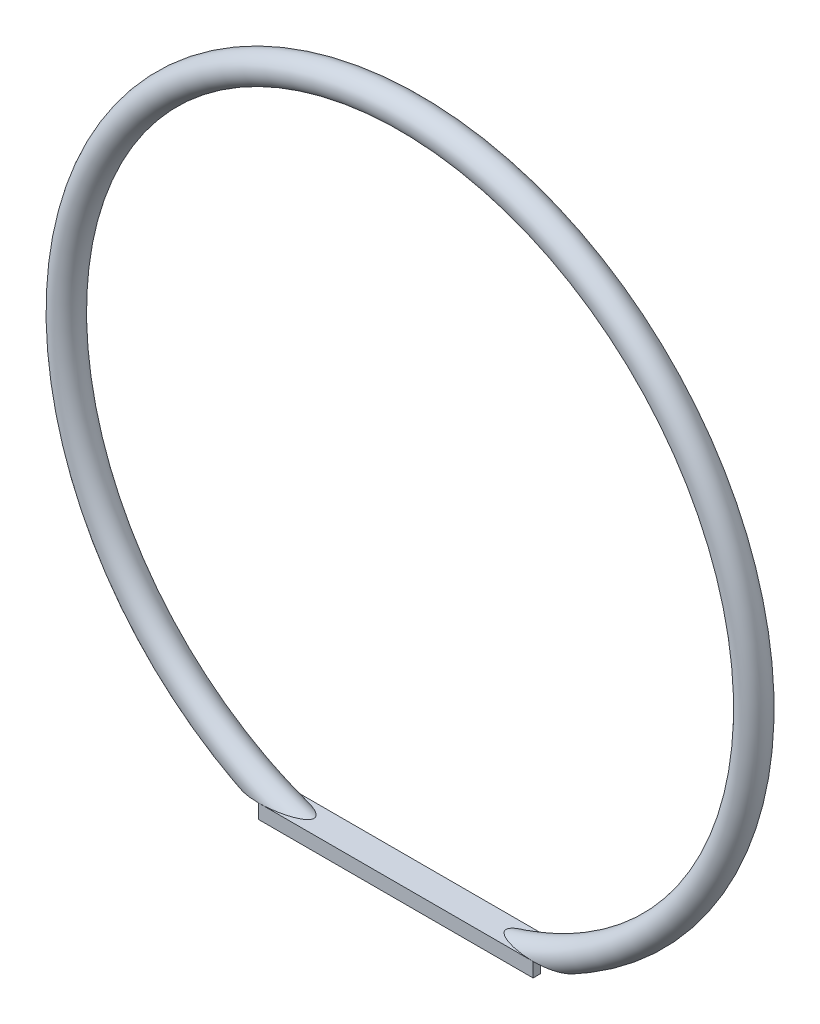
ISO-10303-21;
HEADER;
FILE_DESCRIPTION(('STEP AP214'),'2;1');
FILE_NAME('part.step','',(''),(''),'','','');
FILE_SCHEMA(('AUTOMOTIVE_DESIGN { 1 0 10303 214 1 1 1 1 }'));
ENDSEC;
DATA;
#1=APPLICATION_CONTEXT('core data for automotive mechanical design processes');
#2=APPLICATION_PROTOCOL_DEFINITION('international standard','automotive_design',2000,#1);
#3=PRODUCT_CONTEXT('',#1,'mechanical');
#4=PRODUCT('Part','Part','',(#3));
#5=PRODUCT_RELATED_PRODUCT_CATEGORY('part','',(#4));
#6=PRODUCT_DEFINITION_FORMATION('','',#4);
#7=PRODUCT_DEFINITION_CONTEXT('part definition',#1,'design');
#8=PRODUCT_DEFINITION('design','',#6,#7);
#9=PRODUCT_DEFINITION_SHAPE('','',#8);
#10=(LENGTH_UNIT() NAMED_UNIT(*) SI_UNIT(.MILLI.,.METRE.));
#11=(NAMED_UNIT(*) PLANE_ANGLE_UNIT() SI_UNIT($,.RADIAN.));
#12=(NAMED_UNIT(*) SI_UNIT($,.STERADIAN.) SOLID_ANGLE_UNIT());
#13=UNCERTAINTY_MEASURE_WITH_UNIT(LENGTH_MEASURE(1.E-05),#10,'distance_accuracy_value','');
#14=(GEOMETRIC_REPRESENTATION_CONTEXT(3) GLOBAL_UNCERTAINTY_ASSIGNED_CONTEXT((#13)) GLOBAL_UNIT_ASSIGNED_CONTEXT((#10,
#11,#12)) REPRESENTATION_CONTEXT('',''));
#15=CARTESIAN_POINT('',(0.,0.,0.));
#16=DIRECTION('',(0.,0.,1.));
#17=DIRECTION('',(1.,0.,0.));
#18=AXIS2_PLACEMENT_3D('',#15,#16,#17);
#19=CARTESIAN_POINT('',(0.,-6.35,0.));
#20=DIRECTION('',(0.,-1.,0.));
#21=DIRECTION('',(0.,0.,-1.));
#22=AXIS2_PLACEMENT_3D('',#19,#20,#21);
#23=PLANE('',#22);
#24=DIRECTION('',(0.,0.,1.));
#25=VECTOR('',#24,1.);
#26=CARTESIAN_POINT('',(-121.793,-6.35,12.6999981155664));
#27=LINE('',#26,#25);
#28=CARTESIAN_POINT('',(-121.793,-6.35,-6.34999811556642));
#29=VERTEX_POINT('',#28);
#30=CARTESIAN_POINT('',(-121.793,-6.35,6.34999811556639));
#31=VERTEX_POINT('',#30);
#32=EDGE_CURVE('E44',#29,#31,#27,.T.);
#33=ORIENTED_EDGE('',*,*,#32,.F.);
#34=DIRECTION('',(-1.,0.,0.));
#35=VECTOR('',#34,1.);
#36=CARTESIAN_POINT('',(121.793,-6.35,-6.34999811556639));
#37=LINE('',#36,#35);
#38=CARTESIAN_POINT('',(121.793,-6.35,-6.34999811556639));
#39=VERTEX_POINT('',#38);
#40=EDGE_CURVE('E162',#39,#29,#37,.T.);
#41=ORIENTED_EDGE('',*,*,#40,.F.);
#42=DIRECTION('',(0.,0.,-1.));
#43=VECTOR('',#42,1.);
#44=CARTESIAN_POINT('',(121.793,-6.35,12.6999981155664));
#45=LINE('',#44,#43);
#46=CARTESIAN_POINT('',(121.793,-6.35,6.34999811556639));
#47=VERTEX_POINT('',#46);
#48=EDGE_CURVE('E168',#47,#39,#45,.T.);
#49=ORIENTED_EDGE('',*,*,#48,.F.);
#50=DIRECTION('',(1.,0.,0.));
#51=VECTOR('',#50,1.);
#52=CARTESIAN_POINT('',(-121.793,-6.35,6.34999811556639));
#53=LINE('',#52,#51);
#54=EDGE_CURVE('E170',#31,#47,#53,.T.);
#55=ORIENTED_EDGE('',*,*,#54,.F.);
#56=EDGE_LOOP('',(#33,#41,#49,#55));
#57=FACE_BOUND('',#56,.T.);
#58=ADVANCED_FACE('F39',(#57),#23,.T.);
#59=CARTESIAN_POINT('',(0.,279.4,0.));
#60=DIRECTION('',(0.,0.,-1.));
#61=DIRECTION('',(-1.,0.,0.));
#62=AXIS2_PLACEMENT_3D('',#59,#60,#61);
#63=TOROIDAL_SURFACE('',#62,304.8,12.7);
#64=CARTESIAN_POINT('',(85.3777956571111,0.,1.16561294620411));
#65=CARTESIAN_POINT('',(85.3075648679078,0.,0.942851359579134));
#66=CARTESIAN_POINT('',(85.2557746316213,0.,0.714063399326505));
#67=CARTESIAN_POINT('',(85.1954665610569,0.,0.250922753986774));
#68=CARTESIAN_POINT('',(85.1869038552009,0.,0.0165760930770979));
#69=CARTESIAN_POINT('',(85.2141156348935,0.,-0.449318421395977));
#70=CARTESIAN_POINT('',(85.2498657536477,0.,-0.680867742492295));
#71=CARTESIAN_POINT('',(85.3610360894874,0.,-1.1342694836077));
#72=CARTESIAN_POINT('',(85.4365178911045,0.,-1.35610626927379));
#73=CARTESIAN_POINT('',(85.6522099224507,0.,-1.86262639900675));
#74=CARTESIAN_POINT('',(85.805908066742,0.,-2.14147356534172));
#75=CARTESIAN_POINT('',(86.1540806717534,0.,-2.67224114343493));
#76=CARTESIAN_POINT('',(86.3486516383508,0.,-2.92409565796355));
#77=CARTESIAN_POINT('',(86.7523722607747,0.,-3.38851392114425));
#78=CARTESIAN_POINT('',(86.959865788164,0.,-3.60254646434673));
#79=CARTESIAN_POINT('',(87.3922793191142,0.,-4.01239664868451));
#80=CARTESIAN_POINT('',(87.6172156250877,0.,-4.20819686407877));
#81=CARTESIAN_POINT('',(88.0802715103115,0.,-4.58462071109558));
#82=CARTESIAN_POINT('',(88.3184229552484,0.,-4.76520475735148));
#83=CARTESIAN_POINT('',(88.8041612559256,0.,-5.11287408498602));
#84=CARTESIAN_POINT('',(89.0517443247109,0.,-5.27996470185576));
#85=CARTESIAN_POINT('',(89.7005058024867,0.,-5.69654151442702));
#86=CARTESIAN_POINT('',(90.107221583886,0.,-5.93739034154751));
#87=CARTESIAN_POINT('',(90.9336025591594,0.,-6.39592227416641));
#88=CARTESIAN_POINT('',(91.3532744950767,0.,-6.61359304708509));
#89=CARTESIAN_POINT('',(92.2028696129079,0.,-7.02995491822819));
#90=CARTESIAN_POINT('',(92.6328108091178,0.,-7.22860905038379));
#91=CARTESIAN_POINT('',(93.499846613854,0.,-7.6092961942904));
#92=CARTESIAN_POINT('',(93.9369398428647,0.,-7.79133236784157));
#93=CARTESIAN_POINT('',(94.8190221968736,0.,-8.14182009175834));
#94=CARTESIAN_POINT('',(95.2640397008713,0.,-8.31019991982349));
#95=CARTESIAN_POINT('',(96.1587624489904,0.,-8.63400401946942));
#96=CARTESIAN_POINT('',(96.6084678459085,0.,-8.78942786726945));
#97=CARTESIAN_POINT('',(97.5112695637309,0.,-9.08841068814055));
#98=CARTESIAN_POINT('',(97.9643618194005,0.,-9.2319819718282));
#99=CARTESIAN_POINT('',(98.8738009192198,0.,-9.50841482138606));
#100=CARTESIAN_POINT('',(99.330147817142,0.,-9.64127620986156));
#101=CARTESIAN_POINT('',(100.300843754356,0.,-9.91248151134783));
#102=CARTESIAN_POINT('',(100.8155480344,0.,-10.0495529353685));
#103=CARTESIAN_POINT('',(101.847933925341,0.,-10.3120418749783));
#104=CARTESIAN_POINT('',(102.365615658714,0.,-10.4374589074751));
#105=CARTESIAN_POINT('',(103.403598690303,0.,-10.6772877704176));
#106=CARTESIAN_POINT('',(103.923900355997,0.,-10.7916980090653));
#107=CARTESIAN_POINT('',(104.966715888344,0.,-11.0099715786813));
#108=CARTESIAN_POINT('',(105.489229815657,0.,-11.1138346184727));
#109=CARTESIAN_POINT('',(107.060872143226,0.,-11.4103972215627));
#110=CARTESIAN_POINT('',(108.112922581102,0.,-11.5878000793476));
#111=CARTESIAN_POINT('',(110.222739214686,0.,-11.90353345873));
#112=CARTESIAN_POINT('',(111.280504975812,0.,-12.0418669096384));
#113=CARTESIAN_POINT('',(113.398447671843,0.,-12.2797200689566));
#114=CARTESIAN_POINT('',(114.45861670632,0.,-12.3793100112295));
#115=CARTESIAN_POINT('',(116.581960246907,0.,-12.5395139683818));
#116=CARTESIAN_POINT('',(117.64513490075,0.,-12.6001260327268));
#117=CARTESIAN_POINT('',(119.77204386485,0.,-12.6808978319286));
#118=CARTESIAN_POINT('',(120.835776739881,0.,-12.7010950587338));
#119=CARTESIAN_POINT('',(122.963146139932,0.,-12.6988132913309));
#120=CARTESIAN_POINT('',(124.026782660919,0.,-12.6763394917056));
#121=CARTESIAN_POINT('',(125.653773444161,0.,-12.6066566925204));
#122=CARTESIAN_POINT('',(126.217869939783,0.,-12.575985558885));
#123=CARTESIAN_POINT('',(127.345147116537,0.,-12.5009806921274));
#124=CARTESIAN_POINT('',(127.908327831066,0.,-12.4566474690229));
#125=CARTESIAN_POINT('',(129.033508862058,0.,-12.3535449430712));
#126=CARTESIAN_POINT('',(129.595508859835,0.,-12.2947721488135));
#127=CARTESIAN_POINT('',(130.717703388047,0.,-12.1618930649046));
#128=CARTESIAN_POINT('',(131.277897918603,0.,-12.0877867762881));
#129=CARTESIAN_POINT('',(132.393715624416,0.,-11.9234970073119));
#130=CARTESIAN_POINT('',(132.949348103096,0.,-11.8333770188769));
#131=CARTESIAN_POINT('',(134.057524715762,0.,-11.6356199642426));
#132=CARTESIAN_POINT('',(134.610068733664,0.,-11.5279822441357));
#133=CARTESIAN_POINT('',(135.710858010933,0.,-11.2937717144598));
#134=CARTESIAN_POINT('',(136.259105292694,0.,-11.1672084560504));
#135=CARTESIAN_POINT('',(137.350356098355,0.,-10.8933551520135));
#136=CARTESIAN_POINT('',(137.893360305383,0.,-10.7460678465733));
#137=CARTESIAN_POINT('',(138.913156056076,0.,-10.446119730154));
#138=CARTESIAN_POINT('',(139.390646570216,0.,-10.2958421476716));
#139=CARTESIAN_POINT('',(140.338920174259,0.,-9.97535890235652));
#140=CARTESIAN_POINT('',(140.809703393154,0.,-9.80515362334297));
#141=CARTESIAN_POINT('',(141.744555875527,0.,-9.44192549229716));
#142=CARTESIAN_POINT('',(142.20859166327,0.,-9.24881597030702));
#143=CARTESIAN_POINT('',(143.12551486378,0.,-8.83766304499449));
#144=CARTESIAN_POINT('',(143.5784031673,0.,-8.61962164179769));
#145=CARTESIAN_POINT('',(144.476513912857,0.,-8.15176862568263));
#146=CARTESIAN_POINT('',(144.921509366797,0.,-7.90151769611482));
#147=CARTESIAN_POINT('',(145.791649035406,0.,-7.36767657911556));
#148=CARTESIAN_POINT('',(146.216780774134,0.,-7.08406582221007));
#149=CARTESIAN_POINT('',(147.036729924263,0.,-6.48076351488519));
#150=CARTESIAN_POINT('',(147.431722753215,0.,-6.16131261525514));
#151=CARTESIAN_POINT('',(148.182985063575,0.,-5.47998963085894));
#152=CARTESIAN_POINT('',(148.539325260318,0.,-5.11819762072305));
#153=CARTESIAN_POINT('',(149.001183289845,0.,-4.57739690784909));
#154=CARTESIAN_POINT('',(149.129677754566,0.,-4.41787187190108));
#155=CARTESIAN_POINT('',(149.376295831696,0.,-4.0910617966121));
#156=CARTESIAN_POINT('',(149.494420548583,0.,-3.92377758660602));
#157=CARTESIAN_POINT('',(149.831019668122,0.,-3.40995974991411));
#158=CARTESIAN_POINT('',(150.031863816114,0.,-3.05129548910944));
#159=CARTESIAN_POINT('',(150.287627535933,0.,-2.49012537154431));
#160=CARTESIAN_POINT('',(150.365641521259,0.,-2.29792539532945));
#161=CARTESIAN_POINT('',(150.503956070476,0.,-1.90729232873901));
#162=CARTESIAN_POINT('',(150.564267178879,0.,-1.70886302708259));
#163=CARTESIAN_POINT('',(150.665467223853,0.,-1.30730648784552));
#164=CARTESIAN_POINT('',(150.706375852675,0.,-1.10418423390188));
#165=CARTESIAN_POINT('',(150.767585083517,0.,-0.694851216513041));
#166=CARTESIAN_POINT('',(150.787888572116,0.,-0.488640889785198));
#167=CARTESIAN_POINT('',(150.806154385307,0.,-0.0980449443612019));
#168=CARTESIAN_POINT('',(150.806333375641,0.,0.0862398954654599));
#169=CARTESIAN_POINT('',(150.789856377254,0.,0.454039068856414));
#170=CARTESIAN_POINT('',(150.773202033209,0.,0.637553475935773));
#171=CARTESIAN_POINT('',(150.723489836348,0.,1.00241458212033));
#172=CARTESIAN_POINT('',(150.69042487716,0.,1.18376030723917));
#173=CARTESIAN_POINT('',(150.608718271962,0.,1.5429174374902));
#174=CARTESIAN_POINT('',(150.560073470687,0.,1.72072811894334));
#175=CARTESIAN_POINT('',(150.439265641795,0.,2.10012907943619));
#176=CARTESIAN_POINT('',(150.364571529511,0.,2.30091489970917));
#177=CARTESIAN_POINT('',(150.197684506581,0.,2.69501066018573));
#178=CARTESIAN_POINT('',(150.105488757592,0.,2.88831938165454));
#179=CARTESIAN_POINT('',(149.805527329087,0.,3.45634912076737));
#180=CARTESIAN_POINT('',(149.574465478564,0.,3.81894121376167));
#181=CARTESIAN_POINT('',(149.128102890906,0.,4.42522554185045));
#182=CARTESIAN_POINT('',(148.922605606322,0.,4.67640601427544));
#183=CARTESIAN_POINT('',(148.490312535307,0.,5.15994193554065));
#184=CARTESIAN_POINT('',(148.263505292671,0.,5.39228713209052));
#185=CARTESIAN_POINT('',(147.79263379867,0.,5.83944808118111));
#186=CARTESIAN_POINT('',(147.54854038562,0.,6.05423282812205));
#187=CARTESIAN_POINT('',(147.04668031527,0.,6.46729625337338));
#188=CARTESIAN_POINT('',(146.788908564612,0.,6.66556871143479));
#189=CARTESIAN_POINT('',(146.283145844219,0.,7.03181921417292));
#190=CARTESIAN_POINT('',(146.035986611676,0.,7.20095324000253));
#191=CARTESIAN_POINT('',(145.533968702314,0.,7.52724850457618));
#192=CARTESIAN_POINT('',(145.279111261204,0.,7.68441165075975));
#193=CARTESIAN_POINT('',(144.762729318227,0.,7.98782229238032));
#194=CARTESIAN_POINT('',(144.50119972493,0.,8.13406109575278));
#195=CARTESIAN_POINT('',(143.972665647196,0.,8.41631390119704));
#196=CARTESIAN_POINT('',(143.705660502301,0.,8.5523266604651));
#197=CARTESIAN_POINT('',(142.897000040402,0.,8.94649383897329));
#198=CARTESIAN_POINT('',(142.348358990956,0.,9.1903962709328));
#199=CARTESIAN_POINT('',(141.23787575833,0.,9.64504495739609));
#200=CARTESIAN_POINT('',(140.676037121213,0.,9.85580000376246));
#201=CARTESIAN_POINT('',(139.513790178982,0.,10.2580940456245));
#202=CARTESIAN_POINT('',(138.912864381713,0.,10.4481308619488));
#203=CARTESIAN_POINT('',(137.702685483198,0.,10.7997794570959));
#204=CARTESIAN_POINT('',(137.093430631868,0.,10.9613851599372));
#205=CARTESIAN_POINT('',(135.868204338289,0.,11.2591819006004));
#206=CARTESIAN_POINT('',(135.252227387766,0.,11.395350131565));
#207=CARTESIAN_POINT('',(134.015667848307,0.,11.6444624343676));
#208=CARTESIAN_POINT('',(133.395085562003,0.,11.757408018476));
#209=CARTESIAN_POINT('',(132.147858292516,0.,11.9624589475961));
#210=CARTESIAN_POINT('',(131.521198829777,0.,12.0544756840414));
#211=CARTESIAN_POINT('',(130.265303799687,0.,12.2186932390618));
#212=CARTESIAN_POINT('',(129.636068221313,0.,12.2908939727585));
#213=CARTESIAN_POINT('',(128.376067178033,0.,12.4168007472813));
#214=CARTESIAN_POINT('',(127.745302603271,0.,12.4705157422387));
#215=CARTESIAN_POINT('',(126.4825270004,0.,12.5606173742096));
#216=CARTESIAN_POINT('',(125.850515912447,0.,12.5970031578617));
#217=CARTESIAN_POINT('',(124.042111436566,0.,12.6776434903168));
#218=CARTESIAN_POINT('',(122.864777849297,0.,12.7017751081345));
#219=CARTESIAN_POINT('',(120.510121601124,0.,12.6980232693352));
#220=CARTESIAN_POINT('',(119.332798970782,0.,12.6701316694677));
#221=CARTESIAN_POINT('',(116.978771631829,0.,12.5652585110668));
#222=CARTESIAN_POINT('',(115.802069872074,0.,12.4882111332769));
#223=CARTESIAN_POINT('',(113.45286124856,0.,12.2866384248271));
#224=CARTESIAN_POINT('',(112.28035405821,0.,12.1621168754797));
#225=CARTESIAN_POINT('',(109.947515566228,0.,11.8666815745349));
#226=CARTESIAN_POINT('',(108.787152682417,0.,11.6960194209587));
#227=CARTESIAN_POINT('',(107.052628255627,0.,11.4040196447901));
#228=CARTESIAN_POINT('',(106.4753912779,0.,11.3006714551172));
#229=CARTESIAN_POINT('',(105.323275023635,0.,11.0816041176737));
#230=CARTESIAN_POINT('',(104.748395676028,0.,10.9658853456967));
#231=CARTESIAN_POINT('',(103.602288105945,0.,10.7217809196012));
#232=CARTESIAN_POINT('',(103.031055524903,0.,10.5934157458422));
#233=CARTESIAN_POINT('',(101.891809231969,0.,10.3231867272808));
#234=CARTESIAN_POINT('',(101.323795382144,0.,10.181323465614));
#235=CARTESIAN_POINT('',(100.191735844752,0.,9.88321978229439));
#236=CARTESIAN_POINT('',(99.6276889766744,0.,9.72698385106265));
#237=CARTESIAN_POINT('',(98.5041870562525,0.,9.39887759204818));
#238=CARTESIAN_POINT('',(97.9447315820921,0.,9.22700871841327));
#239=CARTESIAN_POINT('',(97.1646168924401,0.,8.97401072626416));
#240=CARTESIAN_POINT('',(96.941590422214,0.,8.90013910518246));
#241=CARTESIAN_POINT('',(96.4965345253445,0.,8.74946622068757));
#242=CARTESIAN_POINT('',(96.2745050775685,0.,8.67266501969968));
#243=CARTESIAN_POINT('',(95.6100290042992,0.,8.43764091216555));
#244=CARTESIAN_POINT('',(95.1692014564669,0.,8.27479969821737));
#245=CARTESIAN_POINT('',(94.291809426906,0.,7.93494321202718));
#246=CARTESIAN_POINT('',(93.855257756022,0.,7.75789477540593));
#247=CARTESIAN_POINT('',(92.9889015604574,0.,7.38804356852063));
#248=CARTESIAN_POINT('',(92.5590962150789,0.,7.19524273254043));
#249=CARTESIAN_POINT('',(91.7045102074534,0.,6.78954581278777));
#250=CARTESIAN_POINT('',(91.279804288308,0.,6.5764915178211));
#251=CARTESIAN_POINT('',(90.4418960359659,0.,6.12790528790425));
#252=CARTESIAN_POINT('',(90.0287013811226,0.,5.89235879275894));
#253=CARTESIAN_POINT('',(89.42218521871,0.,5.51882192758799));
#254=CARTESIAN_POINT('',(89.2225022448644,0.,5.39113731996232));
#255=CARTESIAN_POINT('',(88.8282705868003,0.,5.12809607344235));
#256=CARTESIAN_POINT('',(88.6337211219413,0.,4.99274061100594));
#257=CARTESIAN_POINT('',(88.2511536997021,0.,4.71353895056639));
#258=CARTESIAN_POINT('',(88.0631280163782,0.,4.56970338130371));
#259=CARTESIAN_POINT('',(87.6950104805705,0.,4.27226788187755));
#260=CARTESIAN_POINT('',(87.5149158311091,0.,4.11867144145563));
#261=CARTESIAN_POINT('',(87.203133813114,0.,3.83516834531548));
#262=CARTESIAN_POINT('',(87.0694772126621,0.,3.70743231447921));
#263=CARTESIAN_POINT('',(86.8097089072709,0.,3.44441583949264));
#264=CARTESIAN_POINT('',(86.683598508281,0.,3.3091340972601));
#265=CARTESIAN_POINT('',(86.4411125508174,0.,3.03071247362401));
#266=CARTESIAN_POINT('',(86.3247108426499,0.,2.8875955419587));
#267=CARTESIAN_POINT('',(86.1036610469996,0.,2.59262184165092));
#268=CARTESIAN_POINT('',(85.9990062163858,0.,2.44077016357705));
#269=CARTESIAN_POINT('',(85.7926422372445,0.,2.10908896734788));
#270=CARTESIAN_POINT('',(85.6927857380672,0.,1.92808641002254));
#271=CARTESIAN_POINT('',(85.516408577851,0.,1.55483253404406));
#272=CARTESIAN_POINT('',(85.4398936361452,0.,1.3625784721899));
#273=CARTESIAN_POINT('',(85.3777956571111,0.,1.16561294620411));
#274=B_SPLINE_CURVE_WITH_KNOTS('',3,(#64,#65,#66,#67,#68,#69,#70,#71,#72,#73,#74,#75,#76,#77,
#78,#79,#80,#81,#82,#83,#84,#85,#86,#87,#88,#89,#90,#91,#92,#93,#94,#95,#96,#97,#98,#99,#100,
#101,#102,#103,#104,#105,#106,#107,#108,#109,#110,#111,#112,#113,#114,#115,#116,#117,#118,#119,
#120,#121,#122,#123,#124,#125,#126,#127,#128,#129,#130,#131,#132,#133,#134,#135,#136,#137,#138,
#139,#140,#141,#142,#143,#144,#145,#146,#147,#148,#149,#150,#151,#152,#153,#154,#155,#156,#157,
#158,#159,#160,#161,#162,#163,#164,#165,#166,#167,#168,#169,#170,#171,#172,#173,#174,#175,#176,
#177,#178,#179,#180,#181,#182,#183,#184,#185,#186,#187,#188,#189,#190,#191,#192,#193,#194,#195,
#196,#197,#198,#199,#200,#201,#202,#203,#204,#205,#206,#207,#208,#209,#210,#211,#212,#213,#214,
#215,#216,#217,#218,#219,#220,#221,#222,#223,#224,#225,#226,#227,#228,#229,#230,#231,#232,#233,
#234,#235,#236,#237,#238,#239,#240,#241,#242,#243,#244,#245,#246,#247,#248,#249,#250,#251,#252,
#253,#254,#255,#256,#257,#258,#259,#260,#261,#262,#263,#264,#265,#266,#267,#268,#269,#270,#271,
#272,#273),.UNSPECIFIED.,.T.,.F.,(4,2,2,2,2,2,2,2,2,2,2,2,2,2,2,2,2,2,2,2,2,2,2,2,2,2,2,2,2,2,2,
2,2,2,2,2,2,2,2,2,2,2,2,2,2,2,2,2,2,2,2,2,2,2,2,2,2,2,2,2,2,2,2,2,2,2,2,2,2,2,2,2,2,2,2,2,2,2,2,
2,2,2,2,2,2,2,2,2,2,2,2,2,2,2,2,2,2,2,2,2,2,2,2,2,4),(0.,0.699985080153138,1.39924340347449,
2.09811738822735,2.79807783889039,3.74792067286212,4.7000319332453,5.59300611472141,
6.48682518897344,7.38290204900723,8.27862283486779,9.69560511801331,11.1133376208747,
12.5337723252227,13.9539362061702,15.3811315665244,16.8083735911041,18.2341140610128,
19.6598781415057,21.2576589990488,22.8555060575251,24.4535838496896,26.0517057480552,
29.2515742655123,32.4512028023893,35.6450037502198,38.8389645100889,42.0299609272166,
45.2205689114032,46.915220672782,48.609809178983,50.3048078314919,51.9998063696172,
53.6882286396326,55.3767139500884,57.064349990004,58.7517630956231,60.2531160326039,
61.7544400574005,63.2616381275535,64.7687153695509,66.2991079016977,67.83044906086,
69.3520622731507,70.8708429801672,71.4849917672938,72.099075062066,73.3265868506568,
73.9481965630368,74.5694352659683,75.1900420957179,75.8105619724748,76.362657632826,
76.9146993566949,77.466980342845,78.0193732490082,78.6610950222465,79.3029209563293,
80.5872992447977,81.5597142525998,82.5326550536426,83.5072782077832,84.4822668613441,
85.380368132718,86.2783259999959,87.1769908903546,88.0757648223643,89.8755914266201,
91.6749398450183,93.5649015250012,95.4552666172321,97.347318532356,99.2392471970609,
101.139042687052,103.038846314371,104.937728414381,106.836704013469,110.368074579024,
113.89999796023,117.436660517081,120.97304143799,124.490514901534,126.249652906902,
128.008737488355,129.765018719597,131.521224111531,133.276882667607,135.032378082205,
135.737187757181,136.441982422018,137.851593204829,139.264595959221,140.67742546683,
142.102375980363,143.52825526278,144.239162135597,144.949960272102,145.659885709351,
146.369558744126,146.923942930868,147.478422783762,148.031357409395,148.583972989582,
149.202747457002,149.821673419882),.UNSPECIFIED.);
#275=CARTESIAN_POINT('',(121.793,0.,-12.6999981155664));
#276=VERTEX_POINT('',#275);
#277=CARTESIAN_POINT('',(121.793,0.,12.6999981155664));
#278=VERTEX_POINT('',#277);
#279=EDGE_CURVE('E266',#276,#278,#274,.T.);
#280=ORIENTED_EDGE('',*,*,#279,.F.);
#281=CARTESIAN_POINT('',(85.295988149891,0.,0.868141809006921));
#282=CARTESIAN_POINT('',(85.2461492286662,0.,0.655736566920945));
#283=CARTESIAN_POINT('',(85.2138119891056,0.,0.439151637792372));
#284=CARTESIAN_POINT('',(85.1878041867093,0.,0.00368700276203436));
#285=CARTESIAN_POINT('',(85.1941150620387,0.,-0.215191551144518));
#286=CARTESIAN_POINT('',(85.2445428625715,0.,-0.647840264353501));
#287=CARTESIAN_POINT('',(85.2885617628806,0.,-0.861622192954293));
#288=CARTESIAN_POINT('',(85.40955906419,0.,-1.27961137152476));
#289=CARTESIAN_POINT('',(85.4865738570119,0.,-1.48380777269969));
#290=CARTESIAN_POINT('',(85.7138116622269,0.,-1.98194466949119));
#291=CARTESIAN_POINT('',(85.8813096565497,0.,-2.26792565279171));
#292=CARTESIAN_POINT('',(86.2577112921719,0.,-2.81113087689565));
#293=CARTESIAN_POINT('',(86.4667353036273,0.,-3.0682680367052));
#294=CARTESIAN_POINT('',(86.9033091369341,0.,-3.54704114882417));
#295=CARTESIAN_POINT('',(87.1297650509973,0.,-3.76969344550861));
#296=CARTESIAN_POINT('',(87.6006757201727,0.,-4.19527107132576));
#297=CARTESIAN_POINT('',(87.8451481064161,0.,-4.39817661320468));
#298=CARTESIAN_POINT('',(88.3475611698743,0.,-4.7876704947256));
#299=CARTESIAN_POINT('',(88.6055322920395,0.,-4.97421916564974));
#300=CARTESIAN_POINT('',(89.131038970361,0.,-5.33296515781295));
#301=CARTESIAN_POINT('',(89.3985704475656,0.,-5.50516849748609));
#302=CARTESIAN_POINT('',(89.8884715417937,0.,-5.80512693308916));
#303=CARTESIAN_POINT('',(90.1095385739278,0.,-5.93502578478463));
#304=CARTESIAN_POINT('',(90.5556989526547,0.,-6.18773149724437));
#305=CARTESIAN_POINT('',(90.7807925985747,0.,-6.31053782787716));
#306=CARTESIAN_POINT('',(91.4612810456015,0.,-6.66951442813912));
#307=CARTESIAN_POINT('',(91.9217210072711,0.,-6.8961446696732));
#308=CARTESIAN_POINT('',(92.8531676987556,0.,-7.32872955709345));
#309=CARTESIAN_POINT('',(93.3241929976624,0.,-7.53464372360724));
#310=CARTESIAN_POINT('',(94.2736002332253,0.,-7.92839904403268));
#311=CARTESIAN_POINT('',(94.7519807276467,0.,-8.11624368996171));
#312=CARTESIAN_POINT('',(95.7171443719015,0.,-8.47715077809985));
#313=CARTESIAN_POINT('',(96.2039586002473,0.,-8.65012968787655));
#314=CARTESIAN_POINT('',(97.1823884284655,0.,-8.98193155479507));
#315=CARTESIAN_POINT('',(97.6740041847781,0.,-9.14075404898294));
#316=CARTESIAN_POINT('',(98.6606643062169,0.,-9.44539471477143));
#317=CARTESIAN_POINT('',(99.1557044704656,0.,-9.59122653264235));
#318=CARTESIAN_POINT('',(100.149111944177,0.,-9.87108584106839));
#319=CARTESIAN_POINT('',(100.647479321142,0.,-10.0051130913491));
#320=CARTESIAN_POINT('',(101.708483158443,0.,-10.2779393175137));
#321=CARTESIAN_POINT('',(102.27148931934,0.,-10.4152996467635));
#322=CARTESIAN_POINT('',(103.400544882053,0.,-10.6769593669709));
#323=CARTESIAN_POINT('',(103.966594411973,0.,-10.8012582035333));
#324=CARTESIAN_POINT('',(105.101367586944,0.,-11.0374262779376));
#325=CARTESIAN_POINT('',(105.670091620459,0.,-11.1492936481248));
#326=CARTESIAN_POINT('',(106.809775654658,0.,-11.3610196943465));
#327=CARTESIAN_POINT('',(107.380735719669,0.,-11.4608780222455));
#328=CARTESIAN_POINT('',(109.098043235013,0.,-11.7431840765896));
#329=CARTESIAN_POINT('',(110.247326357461,0.,-11.908054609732));
#330=CARTESIAN_POINT('',(112.551384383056,0.,-12.1920641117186));
#331=CARTESIAN_POINT('',(113.706158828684,0.,-12.3112068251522));
#332=CARTESIAN_POINT('',(116.016281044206,0.,-12.5031237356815));
#333=CARTESIAN_POINT('',(117.171617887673,0.,-12.5760285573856));
#334=CARTESIAN_POINT('',(119.484412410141,0.,-12.6743587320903));
#335=CARTESIAN_POINT('',(120.641870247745,0.,-12.6997803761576));
#336=CARTESIAN_POINT('',(122.955411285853,0.,-12.7002166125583));
#337=CARTESIAN_POINT('',(124.111494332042,0.,-12.6752962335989));
#338=CARTESIAN_POINT('',(125.843605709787,0.,-12.5969147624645));
#339=CARTESIAN_POINT('',(126.420610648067,0.,-12.5639569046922));
#340=CARTESIAN_POINT('',(127.573609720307,0.,-12.4836466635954));
#341=CARTESIAN_POINT('',(128.149603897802,0.,-12.4362949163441));
#342=CARTESIAN_POINT('',(129.282005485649,0.,-12.328096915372));
#343=CARTESIAN_POINT('',(129.838457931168,0.,-12.2677231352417));
#344=CARTESIAN_POINT('',(130.949484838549,0.,-12.1317973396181));
#345=CARTESIAN_POINT('',(131.504059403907,0.,-12.0562461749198));
#346=CARTESIAN_POINT('',(132.611027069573,0.,-11.8888674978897));
#347=CARTESIAN_POINT('',(133.163419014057,0.,-11.7970323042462));
#348=CARTESIAN_POINT('',(134.265020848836,0.,-11.5958581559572));
#349=CARTESIAN_POINT('',(134.814230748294,0.,-11.4865192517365));
#350=CARTESIAN_POINT('',(135.908066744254,0.,-11.2489530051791));
#351=CARTESIAN_POINT('',(136.45269643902,0.,-11.1207423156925));
#352=CARTESIAN_POINT('',(137.536719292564,0.,-10.8435732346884));
#353=CARTESIAN_POINT('',(138.076112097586,0.,-10.6946134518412));
#354=CARTESIAN_POINT('',(139.147595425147,0.,-10.3739513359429));
#355=CARTESIAN_POINT('',(139.679692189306,0.,-10.2022699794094));
#356=CARTESIAN_POINT('',(140.734936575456,0.,-9.83348485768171));
#357=CARTESIAN_POINT('',(141.258086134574,0.,-9.63638667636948));
#358=CARTESIAN_POINT('',(142.295980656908,0.,-9.21221435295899));
#359=CARTESIAN_POINT('',(142.810652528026,0.,-8.98496032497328));
#360=CARTESIAN_POINT('',(143.824510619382,0.,-8.49725497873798));
#361=CARTESIAN_POINT('',(144.323690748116,0.,-8.23679080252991));
#362=CARTESIAN_POINT('',(145.054886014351,0.,-7.81824160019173));
#363=CARTESIAN_POINT('',(145.295132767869,0.,-7.67446132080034));
#364=CARTESIAN_POINT('',(145.769228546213,0.,-7.37674115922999));
#365=CARTESIAN_POINT('',(146.00307855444,0.,-7.22280285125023));
#366=CARTESIAN_POINT('',(146.462998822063,0.,-6.90412158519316));
#367=CARTESIAN_POINT('',(146.689076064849,0.,-6.73938873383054));
#368=CARTESIAN_POINT('',(147.132148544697,0.,-6.39818641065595));
#369=CARTESIAN_POINT('',(147.349146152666,0.,-6.2217200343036));
#370=CARTESIAN_POINT('',(147.736329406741,0.,-5.88719879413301));
#371=CARTESIAN_POINT('',(147.908207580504,0.,-5.73110501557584));
#372=CARTESIAN_POINT('',(148.243162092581,0.,-5.40973274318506));
#373=CARTESIAN_POINT('',(148.406239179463,0.,-5.2444550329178));
#374=CARTESIAN_POINT('',(148.722217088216,0.,-4.90410119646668));
#375=CARTESIAN_POINT('',(148.875107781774,0.,-4.72901562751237));
#376=CARTESIAN_POINT('',(149.168746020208,0.,-4.36880825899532));
#377=CARTESIAN_POINT('',(149.309489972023,0.,-4.18368351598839));
#378=CARTESIAN_POINT('',(149.578390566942,0.,-3.80081413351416));
#379=CARTESIAN_POINT('',(149.706358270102,0.,-3.60293599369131));
#380=CARTESIAN_POINT('',(149.944973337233,0.,-3.19708825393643));
#381=CARTESIAN_POINT('',(150.055630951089,0.,-2.98912472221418));
#382=CARTESIAN_POINT('',(150.256768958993,0.,-2.56410917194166));
#383=CARTESIAN_POINT('',(150.347289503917,0.,-2.3470762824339));
#384=CARTESIAN_POINT('',(150.50565652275,0.,-1.90489602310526));
#385=CARTESIAN_POINT('',(150.573512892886,0.,-1.67975224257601));
#386=CARTESIAN_POINT('',(150.669507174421,0.,-1.28384715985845));
#387=CARTESIAN_POINT('',(150.703404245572,0.,-1.11446771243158));
#388=CARTESIAN_POINT('',(150.756929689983,0.,-0.773479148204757));
#389=CARTESIAN_POINT('',(150.776560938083,0.,-0.601870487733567));
#390=CARTESIAN_POINT('',(150.801099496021,0.,-0.257656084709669));
#391=CARTESIAN_POINT('',(150.806011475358,0.,-0.0850506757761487));
#392=CARTESIAN_POINT('',(150.801009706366,0.,0.259952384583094));
#393=CARTESIAN_POINT('',(150.791095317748,0.,0.432350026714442));
#394=CARTESIAN_POINT('',(150.756704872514,0.,0.775365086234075));
#395=CARTESIAN_POINT('',(150.732255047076,0.,0.945985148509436));
#396=CARTESIAN_POINT('',(150.669357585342,0.,1.28468066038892));
#397=CARTESIAN_POINT('',(150.630904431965,0.,1.45275507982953));
#398=CARTESIAN_POINT('',(150.540795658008,0.,1.78536897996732));
#399=CARTESIAN_POINT('',(150.489135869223,0.,1.94990732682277));
#400=CARTESIAN_POINT('',(150.373597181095,0.,2.27464949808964));
#401=CARTESIAN_POINT('',(150.309715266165,0.,2.43485224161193));
#402=CARTESIAN_POINT('',(150.143913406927,0.,2.81139237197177));
#403=CARTESIAN_POINT('',(150.036838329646,0.,3.02547204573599));
#404=CARTESIAN_POINT('',(149.80414438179,0.,3.44325474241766));
#405=CARTESIAN_POINT('',(149.678518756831,0.,3.64695394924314));
#406=CARTESIAN_POINT('',(149.277496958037,0.,4.24262053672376));
#407=CARTESIAN_POINT('',(148.978192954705,0.,4.61864528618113));
#408=CARTESIAN_POINT('',(148.396348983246,0.,5.26079408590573));
#409=CARTESIAN_POINT('',(148.121551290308,0.,5.53418264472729));
#410=CARTESIAN_POINT('',(147.549118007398,0.,6.05622842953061));
#411=CARTESIAN_POINT('',(147.251467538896,0.,6.30486929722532));
#412=CARTESIAN_POINT('',(146.638240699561,0.,6.77981802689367));
#413=CARTESIAN_POINT('',(146.322635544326,0.,7.00608833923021));
#414=CARTESIAN_POINT('',(145.67762995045,0.,7.43817873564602));
#415=CARTESIAN_POINT('',(145.348224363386,0.,7.64399108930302));
#416=CARTESIAN_POINT('',(144.688172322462,0.,8.03144265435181));
#417=CARTESIAN_POINT('',(144.357831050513,0.,8.21360502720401));
#418=CARTESIAN_POINT('',(143.688955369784,0.,8.56202073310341));
#419=CARTESIAN_POINT('',(143.350422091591,0.,8.72827624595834));
#420=CARTESIAN_POINT('',(142.666340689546,0.,9.04644848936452));
#421=CARTESIAN_POINT('',(142.32078654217,0.,9.19835221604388));
#422=CARTESIAN_POINT('',(141.624143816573,0.,9.48887139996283));
#423=CARTESIAN_POINT('',(141.273055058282,0.,9.627486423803));
#424=CARTESIAN_POINT('',(140.565741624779,0.,9.8926860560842));
#425=CARTESIAN_POINT('',(140.209509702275,0.,10.0192512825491));
#426=CARTESIAN_POINT('',(139.493236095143,0.,10.2610084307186));
#427=CARTESIAN_POINT('',(139.133194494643,0.,10.3762006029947));
#428=CARTESIAN_POINT('',(138.048535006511,0.,10.7058742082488));
#429=CARTESIAN_POINT('',(137.319083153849,0.,10.904563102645));
#430=CARTESIAN_POINT('',(135.805815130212,0.,11.2761742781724));
#431=CARTESIAN_POINT('',(135.021429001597,0.,11.4467400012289));
#432=CARTESIAN_POINT('',(133.445443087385,0.,11.7510903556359));
#433=CARTESIAN_POINT('',(132.653841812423,0.,11.8848672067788));
#434=CARTESIAN_POINT('',(131.065075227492,0.,12.1194426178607));
#435=CARTESIAN_POINT('',(130.267905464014,0.,12.2202106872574));
#436=CARTESIAN_POINT('',(128.670415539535,0.,12.3915493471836));
#437=CARTESIAN_POINT('',(127.870095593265,0.,12.4621219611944));
#438=CARTESIAN_POINT('',(126.264657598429,0.,12.5756210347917));
#439=CARTESIAN_POINT('',(125.459532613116,0.,12.6184481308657));
#440=CARTESIAN_POINT('',(123.84832455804,0.,12.6779277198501));
#441=CARTESIAN_POINT('',(123.042241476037,0.,12.6945798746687));
#442=CARTESIAN_POINT('',(121.430379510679,0.,12.7031717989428));
#443=CARTESIAN_POINT('',(120.624600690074,0.,12.6951245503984));
#444=CARTESIAN_POINT('',(119.013633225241,0.,12.6554604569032));
#445=CARTESIAN_POINT('',(118.208444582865,0.,12.6238435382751));
#446=CARTESIAN_POINT('',(116.488951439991,0.,12.5319511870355));
#447=CARTESIAN_POINT('',(115.574824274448,0.,12.4683405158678));
#448=CARTESIAN_POINT('',(113.749007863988,0.,12.3124072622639));
#449=CARTESIAN_POINT('',(112.837318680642,0.,12.2200839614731));
#450=CARTESIAN_POINT('',(111.016642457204,0.,12.0068651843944));
#451=CARTESIAN_POINT('',(110.107657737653,0.,11.8859498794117));
#452=CARTESIAN_POINT('',(108.294014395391,0.,11.6152493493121));
#453=CARTESIAN_POINT('',(107.389355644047,0.,11.4654649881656));
#454=CARTESIAN_POINT('',(105.590568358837,0.,11.1369522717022));
#455=CARTESIAN_POINT('',(104.696409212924,0.,10.9583917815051));
#456=CARTESIAN_POINT('',(102.914766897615,0.,10.5699006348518));
#457=CARTESIAN_POINT('',(102.027284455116,0.,10.3599666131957));
#458=CARTESIAN_POINT('',(100.703200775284,0.,10.0194158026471));
#459=CARTESIAN_POINT('',(100.263258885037,0.,9.90169249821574));
#460=CARTESIAN_POINT('',(99.3859228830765,0.,9.65712438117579));
#461=CARTESIAN_POINT('',(98.9485286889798,0.,9.5302798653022));
#462=CARTESIAN_POINT('',(98.0767954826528,0.,9.26684162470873));
#463=CARTESIAN_POINT('',(97.6424557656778,0.,9.13025023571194));
#464=CARTESIAN_POINT('',(96.7772696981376,0.,8.84646157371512));
#465=CARTESIAN_POINT('',(96.3464231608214,0.,8.69926487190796));
#466=CARTESIAN_POINT('',(95.5280613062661,0.,8.40717728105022));
#467=CARTESIAN_POINT('',(95.1401833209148,0.,8.263304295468));
#468=CARTESIAN_POINT('',(94.3685279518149,0.,7.96490038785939));
#469=CARTESIAN_POINT('',(93.9847506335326,0.,7.81036929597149));
#470=CARTESIAN_POINT('',(93.2212392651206,0.,7.48896007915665));
#471=CARTESIAN_POINT('',(92.8415178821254,0.,7.32205174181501));
#472=CARTESIAN_POINT('',(92.0883889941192,0.,6.97457983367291));
#473=CARTESIAN_POINT('',(91.7149809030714,0.,6.79401753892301));
#474=CARTESIAN_POINT('',(90.9732293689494,0.,6.41552037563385));
#475=CARTESIAN_POINT('',(90.6049507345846,0.,6.2174575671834));
#476=CARTESIAN_POINT('',(89.8790599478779,0.,5.80213087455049));
#477=CARTESIAN_POINT('',(89.521453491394,0.,5.58485697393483));
#478=CARTESIAN_POINT('',(88.8222502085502,0.,5.12782243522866));
#479=CARTESIAN_POINT('',(88.4806062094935,0.,4.88813529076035));
#480=CARTESIAN_POINT('',(87.9846929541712,0.,4.5073905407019));
#481=CARTESIAN_POINT('',(87.8222228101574,0.,4.37700895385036));
#482=CARTESIAN_POINT('',(87.5040473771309,0.,4.10826249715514));
#483=CARTESIAN_POINT('',(87.3483412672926,0.,3.96989860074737));
#484=CARTESIAN_POINT('',(86.9458312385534,0.,3.59051344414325));
#485=CARTESIAN_POINT('',(86.7062409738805,0.,3.34166953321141));
#486=CARTESIAN_POINT('',(86.2611996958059,0.,2.81486584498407));
#487=CARTESIAN_POINT('',(86.0556961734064,0.,2.53695194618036));
#488=CARTESIAN_POINT('',(85.7459188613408,0.,2.02966208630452));
#489=CARTESIAN_POINT('',(85.6293431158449,0.,1.80791108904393));
#490=CARTESIAN_POINT('',(85.432914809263,0.,1.34862555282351));
#491=CARTESIAN_POINT('',(85.3530003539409,0.,1.11111839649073));
#492=CARTESIAN_POINT('',(85.295988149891,0.,0.868141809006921));
#493=B_SPLINE_CURVE_WITH_KNOTS('',3,(#281,#282,#283,#284,#285,#286,#287,#288,#289,#290,#291,
#292,#293,#294,#295,#296,#297,#298,#299,#300,#301,#302,#303,#304,#305,#306,#307,#308,#309,#310,
#311,#312,#313,#314,#315,#316,#317,#318,#319,#320,#321,#322,#323,#324,#325,#326,#327,#328,#329,
#330,#331,#332,#333,#334,#335,#336,#337,#338,#339,#340,#341,#342,#343,#344,#345,#346,#347,#348,
#349,#350,#351,#352,#353,#354,#355,#356,#357,#358,#359,#360,#361,#362,#363,#364,#365,#366,#367,
#368,#369,#370,#371,#372,#373,#374,#375,#376,#377,#378,#379,#380,#381,#382,#383,#384,#385,#386,
#387,#388,#389,#390,#391,#392,#393,#394,#395,#396,#397,#398,#399,#400,#401,#402,#403,#404,#405,
#406,#407,#408,#409,#410,#411,#412,#413,#414,#415,#416,#417,#418,#419,#420,#421,#422,#423,#424,
#425,#426,#427,#428,#429,#430,#431,#432,#433,#434,#435,#436,#437,#438,#439,#440,#441,#442,#443,
#444,#445,#446,#447,#448,#449,#450,#451,#452,#453,#454,#455,#456,#457,#458,#459,#460,#461,#462,
#463,#464,#465,#466,#467,#468,#469,#470,#471,#472,#473,#474,#475,#476,#477,#478,#479,#480,#481,
#482,#483,#484,#485,#486,#487,#488,#489,#490,#491,#492),.UNSPECIFIED.,.T.,.F.,(4,2,2,2,2,2,2,2,
2,2,2,2,2,2,2,2,2,2,2,2,2,2,2,2,2,2,2,2,2,2,2,2,2,2,2,2,2,2,2,2,2,2,2,2,2,2,2,2,2,2,2,2,2,2,2,2,
2,2,2,2,2,2,2,2,2,2,2,2,2,2,2,2,2,2,2,2,2,2,2,2,2,2,2,2,2,2,2,2,2,2,2,2,2,2,2,2,2,2,2,2,2,2,2,2,
2,4),(0.,0.653741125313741,1.30716829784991,1.95890197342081,2.61135631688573,3.59993138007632,
4.59141494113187,5.54272214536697,6.49497299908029,7.44947281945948,8.40357015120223,
9.17265119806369,9.94178965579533,11.4806340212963,13.0224291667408,14.563925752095,
16.1135840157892,17.6632929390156,19.2113542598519,20.7594470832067,22.4978383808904,
24.2363034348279,25.9750293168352,27.7138055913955,31.1959241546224,34.6777575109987,
38.1497101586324,41.6219339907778,45.0896754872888,46.8233657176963,48.5569793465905,
50.235940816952,51.9148081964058,53.5944696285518,55.2741262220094,56.952309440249,
58.6306052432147,60.3073623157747,61.9837516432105,63.6706327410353,65.358168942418,
66.1979147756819,67.0375307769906,67.8763715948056,68.7149919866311,69.4112252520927,
70.1073992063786,70.8042553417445,71.501316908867,72.2075054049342,72.9132741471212,
73.6176228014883,74.3216635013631,74.8393234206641,75.3568789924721,75.8742703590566,
76.3916840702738,76.9081668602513,77.4248533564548,77.9417031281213,78.4586805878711,
79.1756400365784,79.8928611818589,81.3289743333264,82.4904178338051,83.6526240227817,
84.816749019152,85.9813122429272,87.1125543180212,88.243641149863,89.3757432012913,
90.5078821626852,91.6418124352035,92.7757177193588,95.0425729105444,97.4497602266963,
99.8574562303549,102.267370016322,104.677122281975,107.095457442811,109.513823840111,
111.930919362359,114.348022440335,117.096563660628,119.845173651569,122.595695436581,
125.346134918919,128.081074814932,130.816308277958,132.182489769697,133.548626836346,
134.914437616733,136.280174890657,137.521140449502,138.762125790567,140.006246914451,
141.250251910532,142.504253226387,143.758912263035,145.009592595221,145.63432146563,
146.258974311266,147.293222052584,148.325861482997,149.07496452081,149.822798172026),.UNSPECIFIED.);
#494=EDGE_CURVE('E250',#278,#276,#493,.T.);
#495=ORIENTED_EDGE('',*,*,#494,.F.);
#496=EDGE_LOOP('',(#280,#495));
#497=FACE_BOUND('',#496,.T.);
#498=CARTESIAN_POINT('',(-150.785561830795,0.,-0.473390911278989));
#499=CARTESIAN_POINT('',(-150.770632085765,0.,-0.66345564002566));
#500=CARTESIAN_POINT('',(-150.746733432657,0.,-0.852834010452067));
#501=CARTESIAN_POINT('',(-150.681647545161,0.,-1.22866521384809));
#502=CARTESIAN_POINT('',(-150.64045132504,0.,-1.4151164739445));
#503=CARTESIAN_POINT('',(-150.541744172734,0.,-1.78402828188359));
#504=CARTESIAN_POINT('',(-150.484200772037,0.,-1.96648010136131));
#505=CARTESIAN_POINT('',(-150.354148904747,0.,-2.3260437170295));
#506=CARTESIAN_POINT('',(-150.281632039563,0.,-2.50315245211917));
#507=CARTESIAN_POINT('',(-150.101397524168,0.,-2.89889288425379));
#508=CARTESIAN_POINT('',(-149.989478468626,0.,-3.11561342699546));
#509=CARTESIAN_POINT('',(-149.746750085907,0.,-3.53831520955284));
#510=CARTESIAN_POINT('',(-149.615926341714,0.,-3.74428808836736));
#511=CARTESIAN_POINT('',(-149.338135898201,0.,-4.14531184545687));
#512=CARTESIAN_POINT('',(-149.191152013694,0.,-4.34035075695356));
#513=CARTESIAN_POINT('',(-148.883710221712,0.,-4.71934163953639));
#514=CARTESIAN_POINT('',(-148.723255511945,0.,-4.90329622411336));
#515=CARTESIAN_POINT('',(-148.286904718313,0.,-5.37246745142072));
#516=CARTESIAN_POINT('',(-148.001625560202,0.,-5.64897939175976));
#517=CARTESIAN_POINT('',(-147.4081686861,0.,-6.17624420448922));
#518=CARTESIAN_POINT('',(-147.099975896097,0.,-6.4269798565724));
#519=CARTESIAN_POINT('',(-146.465511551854,0.,-6.90548203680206));
#520=CARTESIAN_POINT('',(-146.139209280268,0.,-7.13320756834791));
#521=CARTESIAN_POINT('',(-145.472804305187,0.,-7.56761770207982));
#522=CARTESIAN_POINT('',(-145.132696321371,0.,-7.77429414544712));
#523=CARTESIAN_POINT('',(-144.449441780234,0.,-8.16418529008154));
#524=CARTESIAN_POINT('',(-144.106535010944,0.,-8.34782266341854));
#525=CARTESIAN_POINT('',(-143.412479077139,0.,-8.6985950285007));
#526=CARTESIAN_POINT('',(-143.061331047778,0.,-8.86573227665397));
#527=CARTESIAN_POINT('',(-142.351987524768,0.,-9.18515270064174));
#528=CARTESIAN_POINT('',(-141.993785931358,0.,-9.33742227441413));
#529=CARTESIAN_POINT('',(-141.271852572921,0.,-9.62821311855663));
#530=CARTESIAN_POINT('',(-140.908120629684,0.,-9.76673394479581));
#531=CARTESIAN_POINT('',(-140.175523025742,0.,-10.031330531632));
#532=CARTESIAN_POINT('',(-139.806650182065,0.,-10.1573863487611));
#533=CARTESIAN_POINT('',(-139.065125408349,0.,-10.3977477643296));
#534=CARTESIAN_POINT('',(-138.692473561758,0.,-10.5120536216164));
#535=CARTESIAN_POINT('',(-137.570053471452,0.,-10.8385492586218));
#536=CARTESIAN_POINT('',(-136.815505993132,0.,-11.0344288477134));
#537=CARTESIAN_POINT('',(-135.251181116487,0.,-11.3988979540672));
#538=CARTESIAN_POINT('',(-134.440851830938,0.,-11.5650808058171));
#539=CARTESIAN_POINT('',(-132.813216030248,0.,-11.8595025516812));
#540=CARTESIAN_POINT('',(-131.995908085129,0.,-11.9877334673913));
#541=CARTESIAN_POINT('',(-130.355944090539,0.,-12.2101422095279));
#542=CARTESIAN_POINT('',(-129.533283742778,0.,-12.3042879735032));
#543=CARTESIAN_POINT('',(-127.885078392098,0.,-12.4613657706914));
#544=CARTESIAN_POINT('',(-127.059533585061,0.,-12.5242998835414));
#545=CARTESIAN_POINT('',(-125.403880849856,0.,-12.6215039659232));
#546=CARTESIAN_POINT('',(-124.57376706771,0.,-12.6556727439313));
#547=CARTESIAN_POINT('',(-122.912873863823,0.,-12.6968519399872));
#548=CARTESIAN_POINT('',(-122.082094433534,0.,-12.7038620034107));
#549=CARTESIAN_POINT('',(-120.421220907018,0.,-12.6921743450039));
#550=CARTESIAN_POINT('',(-119.59112669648,0.,-12.6734918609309));
#551=CARTESIAN_POINT('',(-117.931867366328,0.,-12.6115176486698));
#552=CARTESIAN_POINT('',(-117.102702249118,0.,-12.5682258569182));
#553=CARTESIAN_POINT('',(-115.336036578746,0.,-12.450439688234));
#554=CARTESIAN_POINT('',(-114.398760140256,0.,-12.3725672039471));
#555=CARTESIAN_POINT('',(-112.527173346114,0.,-12.1867440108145));
#556=CARTESIAN_POINT('',(-111.592863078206,0.,-12.0787924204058));
#557=CARTESIAN_POINT('',(-109.727288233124,0.,-11.832663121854));
#558=CARTESIAN_POINT('',(-108.796027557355,0.,-11.6944557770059));
#559=CARTESIAN_POINT('',(-106.938644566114,0.,-11.3871957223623));
#560=CARTESIAN_POINT('',(-106.012522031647,0.,-11.2181443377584));
#561=CARTESIAN_POINT('',(-104.170077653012,0.,-10.8483613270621));
#562=CARTESIAN_POINT('',(-103.253732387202,0.,-10.6477474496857));
#563=CARTESIAN_POINT('',(-101.885385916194,0.,-10.3207479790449));
#564=CARTESIAN_POINT('',(-101.430246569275,0.,-10.207387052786));
#565=CARTESIAN_POINT('',(-100.522357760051,0.,-9.97148546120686));
#566=CARTESIAN_POINT('',(-100.06960822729,0.,-9.84894506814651));
#567=CARTESIAN_POINT('',(-99.1675703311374,0.,-9.59429279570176));
#568=CARTESIAN_POINT('',(-98.718277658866,0.,-9.46219620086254));
#569=CARTESIAN_POINT('',(-97.8229224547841,0.,-9.18751740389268));
#570=CARTESIAN_POINT('',(-97.3768597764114,0.,-9.04493568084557));
#571=CARTESIAN_POINT('',(-96.4886958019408,0.,-8.74837835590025));
#572=CARTESIAN_POINT('',(-96.0465932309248,0.,-8.59440658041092));
#573=CARTESIAN_POINT('',(-95.1670178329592,0.,-8.27382098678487));
#574=CARTESIAN_POINT('',(-94.7295445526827,0.,-8.10720841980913));
#575=CARTESIAN_POINT('',(-94.0624438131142,0.,-7.84054676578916));
#576=CARTESIAN_POINT('',(-93.8307794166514,0.,-7.74557977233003));
#577=CARTESIAN_POINT('',(-93.3693015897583,0.,-7.55126178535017));
#578=CARTESIAN_POINT('',(-93.1394881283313,0.,-7.45191086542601));
#579=CARTESIAN_POINT('',(-92.4530675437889,0.,-7.14672307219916));
#580=CARTESIAN_POINT('',(-91.9995814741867,0.,-6.93379126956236));
#581=CARTESIAN_POINT('',(-91.105293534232,0.,-6.48629890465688));
#582=CARTESIAN_POINT('',(-90.664452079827,0.,-6.25181846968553));
#583=CARTESIAN_POINT('',(-90.0149926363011,0.,-5.87974245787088));
#584=CARTESIAN_POINT('',(-89.800514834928,0.,-5.75235196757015));
#585=CARTESIAN_POINT('',(-89.3762949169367,0.,-5.48993731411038));
#586=CARTESIAN_POINT('',(-89.1665521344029,0.,-5.35491423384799));
#587=CARTESIAN_POINT('',(-88.7906176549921,0.,-5.1016883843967));
#588=CARTESIAN_POINT('',(-88.6234648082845,0.,-4.98491417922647));
#589=CARTESIAN_POINT('',(-88.2937988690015,0.,-4.74497095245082));
#590=CARTESIAN_POINT('',(-88.1312857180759,0.,-4.62180201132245));
#591=CARTESIAN_POINT('',(-87.8114136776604,0.,-4.36795628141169));
#592=CARTESIAN_POINT('',(-87.6540715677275,0.,-4.23725823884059));
#593=CARTESIAN_POINT('',(-87.3463794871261,0.,-3.96786002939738));
#594=CARTESIAN_POINT('',(-87.1960293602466,0.,-3.82916004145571));
#595=CARTESIAN_POINT('',(-86.9019580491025,0.,-3.54073542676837));
#596=CARTESIAN_POINT('',(-86.7583607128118,0.,-3.39088260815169));
#597=CARTESIAN_POINT('',(-86.4826329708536,0.,-3.08104198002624));
#598=CARTESIAN_POINT('',(-86.3505065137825,0.,-2.92105071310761));
#599=CARTESIAN_POINT('',(-85.9771406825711,0.,-2.42558427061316));
#600=CARTESIAN_POINT('',(-85.7569186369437,0.,-2.07276341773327));
#601=CARTESIAN_POINT('',(-85.4906287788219,0.,-1.4945702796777));
#602=CARTESIAN_POINT('',(-85.4109716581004,0.,-1.28468351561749));
#603=CARTESIAN_POINT('',(-85.2866255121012,0.,-0.854741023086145));
#604=CARTESIAN_POINT('',(-85.2418923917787,0.,-0.634698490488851));
#605=CARTESIAN_POINT('',(-85.1922609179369,0.,-0.188771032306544));
#606=CARTESIAN_POINT('',(-85.1875891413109,0.,0.0371398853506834));
#607=CARTESIAN_POINT('',(-85.2192701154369,0.,0.486102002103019));
#608=CARTESIAN_POINT('',(-85.2556497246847,0.,0.709151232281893));
#609=CARTESIAN_POINT('',(-85.3739150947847,0.,1.18084659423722));
#610=CARTESIAN_POINT('',(-85.46215932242,0.,1.42786625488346));
#611=CARTESIAN_POINT('',(-85.6773862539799,0.,1.90437072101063));
#612=CARTESIAN_POINT('',(-85.8044428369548,0.,2.13382103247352));
#613=CARTESIAN_POINT('',(-86.0604815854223,0.,2.5329236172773));
#614=CARTESIAN_POINT('',(-86.1846644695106,0.,2.70573649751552));
#615=CARTESIAN_POINT('',(-86.4476270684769,0.,3.03997762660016));
#616=CARTESIAN_POINT('',(-86.5864169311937,0.,3.2013978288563));
#617=CARTESIAN_POINT('',(-86.8755713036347,0.,3.51411052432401));
#618=CARTESIAN_POINT('',(-87.0259620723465,0.,3.6653785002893));
#619=CARTESIAN_POINT('',(-87.3355647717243,0.,3.95845109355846));
#620=CARTESIAN_POINT('',(-87.4947745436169,0.,4.10025800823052));
#621=CARTESIAN_POINT('',(-87.8805708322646,0.,4.42652183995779));
#622=CARTESIAN_POINT('',(-88.1102573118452,0.,4.60730440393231));
#623=CARTESIAN_POINT('',(-88.5796150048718,0.,4.95549588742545));
#624=CARTESIAN_POINT('',(-88.8192907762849,0.,5.12289859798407));
#625=CARTESIAN_POINT('',(-89.306676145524,0.,5.44637315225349));
#626=CARTESIAN_POINT('',(-89.554397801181,0.,5.60242673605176));
#627=CARTESIAN_POINT('',(-90.0559298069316,0.,5.90443509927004));
#628=CARTESIAN_POINT('',(-90.3097408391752,0.,6.05038874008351));
#629=CARTESIAN_POINT('',(-90.8235026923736,0.,6.33407989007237));
#630=CARTESIAN_POINT('',(-91.0834773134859,0.,6.47177413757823));
#631=CARTESIAN_POINT('',(-91.6074974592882,0.,6.73917443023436));
#632=CARTESIAN_POINT('',(-91.8715430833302,0.,6.86888028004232));
#633=CARTESIAN_POINT('',(-92.4027724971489,0.,7.12099173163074));
#634=CARTESIAN_POINT('',(-92.6699529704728,0.,7.24340433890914));
#635=CARTESIAN_POINT('',(-93.2071907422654,0.,7.48173255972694));
#636=CARTESIAN_POINT('',(-93.4772480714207,0.,7.59764810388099));
#637=CARTESIAN_POINT('',(-94.1633564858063,0.,7.88329917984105));
#638=CARTESIAN_POINT('',(-94.5810621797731,0.,8.04906609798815));
#639=CARTESIAN_POINT('',(-95.4211549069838,0.,8.36832556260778));
#640=CARTESIAN_POINT('',(-95.8435423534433,0.,8.52181701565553));
#641=CARTESIAN_POINT('',(-96.6923116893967,0.,8.81778221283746));
#642=CARTESIAN_POINT('',(-97.1186948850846,0.,8.96025220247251));
#643=CARTESIAN_POINT('',(-97.9747198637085,0.,9.23508135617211));
#644=CARTESIAN_POINT('',(-98.4043617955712,0.,9.36744005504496));
#645=CARTESIAN_POINT('',(-99.2671200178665,0.,9.6230087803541));
#646=CARTESIAN_POINT('',(-99.700240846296,0.,9.74620346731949));
#647=CARTESIAN_POINT('',(-100.568889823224,0.,9.98380720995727));
#648=CARTESIAN_POINT('',(-101.004418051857,0.,10.0982159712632));
#649=CARTESIAN_POINT('',(-102.314182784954,0.,10.4290263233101));
#650=CARTESIAN_POINT('',(-103.191590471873,0.,10.6330093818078));
#651=CARTESIAN_POINT('',(-104.513628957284,0.,10.9164263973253));
#652=CARTESIAN_POINT('',(-104.955872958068,0.,11.0072420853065));
#653=CARTESIAN_POINT('',(-105.841788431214,0.,11.1814525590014));
#654=CARTESIAN_POINT('',(-106.285459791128,0.,11.2648479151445));
#655=CARTESIAN_POINT('',(-107.618472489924,0.,11.5042191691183));
#656=CARTESIAN_POINT('',(-108.509776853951,0.,11.6493726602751));
#657=CARTESIAN_POINT('',(-110.295510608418,0.,11.9115820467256));
#658=CARTESIAN_POINT('',(-111.189935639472,0.,12.0286678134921));
#659=CARTESIAN_POINT('',(-112.981963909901,0.,12.2352220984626));
#660=CARTESIAN_POINT('',(-113.879567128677,0.,12.3246907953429));
#661=CARTESIAN_POINT('',(-115.750965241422,0.,12.4819940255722));
#662=CARTESIAN_POINT('',(-116.724961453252,0.,12.5474473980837));
#663=CARTESIAN_POINT('',(-118.674662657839,0.,12.644844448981));
#664=CARTESIAN_POINT('',(-119.650367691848,0.,12.6767873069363));
#665=CARTESIAN_POINT('',(-121.603427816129,0.,12.7056250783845));
#666=CARTESIAN_POINT('',(-122.580783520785,0.,12.7024800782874));
#667=CARTESIAN_POINT('',(-124.534659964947,0.,12.6587956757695));
#668=CARTESIAN_POINT('',(-125.511180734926,0.,12.6182577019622));
#669=CARTESIAN_POINT('',(-127.456846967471,0.,12.497027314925));
#670=CARTESIAN_POINT('',(-128.426004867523,0.,12.4165371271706));
#671=CARTESIAN_POINT('',(-130.359930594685,0.,12.2114745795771));
#672=CARTESIAN_POINT('',(-131.324697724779,0.,12.0868954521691));
#673=CARTESIAN_POINT('',(-132.765189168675,0.,11.8630868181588));
#674=CARTESIAN_POINT('',(-133.243837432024,0.,11.7824118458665));
#675=CARTESIAN_POINT('',(-134.198719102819,0.,11.6078996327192));
#676=CARTESIAN_POINT('',(-134.674952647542,0.,11.5140631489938));
#677=CARTESIAN_POINT('',(-135.624263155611,0.,11.3123075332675));
#678=CARTESIAN_POINT('',(-136.097341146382,0.,11.2043932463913));
#679=CARTESIAN_POINT('',(-137.03973985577,0.,10.9733459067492));
#680=CARTESIAN_POINT('',(-137.509060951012,0.,10.8502144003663));
#681=CARTESIAN_POINT('',(-138.299929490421,0.,10.6276800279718));
#682=CARTESIAN_POINT('',(-138.622687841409,0.,10.5325688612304));
#683=CARTESIAN_POINT('',(-139.26558308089,0.,10.3338812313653));
#684=CARTESIAN_POINT('',(-139.585720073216,0.,10.2303051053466));
#685=CARTESIAN_POINT('',(-140.223041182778,0.,10.0140790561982));
#686=CARTESIAN_POINT('',(-140.540224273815,0.,9.90142610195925));
#687=CARTESIAN_POINT('',(-141.170989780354,0.,9.66642935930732));
#688=CARTESIAN_POINT('',(-141.484572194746,0.,9.54408556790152));
#689=CARTESIAN_POINT('',(-142.106268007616,0.,9.28946984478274));
#690=CARTESIAN_POINT('',(-142.414397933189,0.,9.15723837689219));
#691=CARTESIAN_POINT('',(-143.025621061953,0.,8.88161491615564));
#692=CARTESIAN_POINT('',(-143.328714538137,0.,8.73822353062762));
#693=CARTESIAN_POINT('',(-143.928700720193,0.,8.43943296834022));
#694=CARTESIAN_POINT('',(-144.225597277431,0.,8.28404155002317));
#695=CARTESIAN_POINT('',(-144.812105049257,0.,7.96013597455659));
#696=CARTESIAN_POINT('',(-145.101717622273,0.,7.79162428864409));
#697=CARTESIAN_POINT('',(-145.638972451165,0.,7.46068564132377));
#698=CARTESIAN_POINT('',(-145.887579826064,0.,7.29982872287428));
#699=CARTESIAN_POINT('',(-146.376537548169,0.,6.96600142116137));
#700=CARTESIAN_POINT('',(-146.616888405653,0.,6.79303178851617));
#701=CARTESIAN_POINT('',(-147.088155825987,0.,6.43358475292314));
#702=CARTESIAN_POINT('',(-147.319050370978,0.,6.247078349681));
#703=CARTESIAN_POINT('',(-147.768668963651,0.,5.85985526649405));
#704=CARTESIAN_POINT('',(-147.987392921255,0.,5.65913848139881));
#705=CARTESIAN_POINT('',(-148.413101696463,0.,5.23935140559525));
#706=CARTESIAN_POINT('',(-148.619860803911,0.,5.02005069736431));
#707=CARTESIAN_POINT('',(-149.014451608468,0.,4.56481662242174));
#708=CARTESIAN_POINT('',(-149.202279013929,0.,4.32887950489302));
#709=CARTESIAN_POINT('',(-149.553834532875,0.,3.84087363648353));
#710=CARTESIAN_POINT('',(-149.717648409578,0.,3.58886714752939));
#711=CARTESIAN_POINT('',(-150.01663336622,0.,3.06845062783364));
#712=CARTESIAN_POINT('',(-150.151831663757,0.,2.80005650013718));
#713=CARTESIAN_POINT('',(-150.340362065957,0.,2.35977881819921));
#714=CARTESIAN_POINT('',(-150.404732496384,0.,2.1925748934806));
#715=CARTESIAN_POINT('',(-150.520077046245,0.,1.85362893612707));
#716=CARTESIAN_POINT('',(-150.571055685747,0.,1.68188845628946));
#717=CARTESIAN_POINT('',(-150.658481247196,0.,1.33506447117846));
#718=CARTESIAN_POINT('',(-150.694954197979,0.,1.15998754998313));
#719=CARTESIAN_POINT('',(-150.752646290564,0.,0.807390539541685));
#720=CARTESIAN_POINT('',(-150.773871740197,0.,0.629871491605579));
#721=CARTESIAN_POINT('',(-150.798757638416,0.,0.297854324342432));
#722=CARTESIAN_POINT('',(-150.804411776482,0.,0.143503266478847));
#723=CARTESIAN_POINT('',(-150.80385776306,0.,-0.165178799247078));
#724=CARTESIAN_POINT('',(-150.797649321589,0.,-0.319509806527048));
#725=CARTESIAN_POINT('',(-150.785561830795,0.,-0.473390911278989));
#726=B_SPLINE_CURVE_WITH_KNOTS('',3,(#498,#499,#500,#501,#502,#503,#504,#505,#506,#507,#508,
#509,#510,#511,#512,#513,#514,#515,#516,#517,#518,#519,#520,#521,#522,#523,#524,#525,#526,#527,
#528,#529,#530,#531,#532,#533,#534,#535,#536,#537,#538,#539,#540,#541,#542,#543,#544,#545,#546,
#547,#548,#549,#550,#551,#552,#553,#554,#555,#556,#557,#558,#559,#560,#561,#562,#563,#564,#565,
#566,#567,#568,#569,#570,#571,#572,#573,#574,#575,#576,#577,#578,#579,#580,#581,#582,#583,#584,
#585,#586,#587,#588,#589,#590,#591,#592,#593,#594,#595,#596,#597,#598,#599,#600,#601,#602,#603,
#604,#605,#606,#607,#608,#609,#610,#611,#612,#613,#614,#615,#616,#617,#618,#619,#620,#621,#622,
#623,#624,#625,#626,#627,#628,#629,#630,#631,#632,#633,#634,#635,#636,#637,#638,#639,#640,#641,
#642,#643,#644,#645,#646,#647,#648,#649,#650,#651,#652,#653,#654,#655,#656,#657,#658,#659,#660,
#661,#662,#663,#664,#665,#666,#667,#668,#669,#670,#671,#672,#673,#674,#675,#676,#677,#678,#679,
#680,#681,#682,#683,#684,#685,#686,#687,#688,#689,#690,#691,#692,#693,#694,#695,#696,#697,#698,
#699,#700,#701,#702,#703,#704,#705,#706,#707,#708,#709,#710,#711,#712,#713,#714,#715,#716,#717,
#718,#719,#720,#721,#722,#723,#724,#725),.UNSPECIFIED.,.T.,.F.,(4,2,2,2,2,2,2,2,2,2,2,2,2,2,2,2,
2,2,2,2,2,2,2,2,2,2,2,2,2,2,2,2,2,2,2,2,2,2,2,2,2,2,2,2,2,2,2,2,2,2,2,2,2,2,2,2,2,2,2,2,2,2,2,2,
2,2,2,2,2,2,2,2,2,2,2,2,2,2,2,2,2,2,2,2,2,2,2,2,2,2,2,2,2,2,2,2,2,2,2,2,2,2,2,2,2,2,2,2,2,2,2,2,
2,4),(0.,0.57178065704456,1.14385871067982,1.71708105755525,2.29062580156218,3.02123739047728,
3.75240912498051,4.48436607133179,5.21614975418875,6.40607177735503,7.59678365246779,
8.7895809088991,9.98283875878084,11.1492977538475,12.3155970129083,13.482953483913,
14.6503476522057,15.8195803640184,16.9887873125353,19.3262010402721,21.8067947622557,
24.2879095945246,26.771352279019,29.2546294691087,31.7466063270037,34.2386157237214,
36.7291477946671,39.2196862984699,42.0407018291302,44.8618000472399,47.6856741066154,
50.509426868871,53.322884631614,54.7299399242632,56.1369535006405,57.5417643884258,
58.9465111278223,60.3507880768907,61.7549262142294,62.506008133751,63.2570774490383,
64.7595425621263,66.256630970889,67.0048770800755,67.7530172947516,68.364595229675,
68.9761654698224,69.5895558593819,70.202932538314,70.824985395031,71.4472515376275,
72.683687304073,73.3547979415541,74.0250598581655,74.6991101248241,75.373601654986,
76.1561871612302,76.9402716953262,77.5777933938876,78.215760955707,78.8552175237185,
79.494518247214,80.3707854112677,81.2474568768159,82.1255089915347,83.0036599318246,
83.8860681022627,84.7684978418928,85.6500658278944,86.5316432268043,87.8795938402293,
89.2276643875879,90.5761921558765,91.92478192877,93.2755805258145,94.6264243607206,
97.3281397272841,98.6825105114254,100.036777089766,102.74541937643,105.451166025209,
108.156895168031,111.084909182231,114.012994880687,116.944411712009,119.875716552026,
122.79233308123,125.709397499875,127.165446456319,128.621411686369,130.076877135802,
131.532194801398,132.541534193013,133.550833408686,134.560471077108,135.570109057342,
136.575820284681,137.581476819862,138.586488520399,139.591311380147,140.479320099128,
141.367273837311,142.257189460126,143.147111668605,144.05040265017,144.953897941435,
145.85408342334,146.753408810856,147.290427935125,147.827265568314,148.363135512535,
148.898783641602,149.361700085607,149.82462784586),.UNSPECIFIED.);
#727=CARTESIAN_POINT('',(-121.793,0.,-12.6999981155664));
#728=VERTEX_POINT('',#727);
#729=CARTESIAN_POINT('',(-121.793,0.,12.6999981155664));
#730=VERTEX_POINT('',#729);
#731=EDGE_CURVE('E11',#728,#730,#726,.T.);
#732=ORIENTED_EDGE('',*,*,#731,.F.);
#733=EDGE_CURVE('E51',#730,#728,#726,.T.);
#734=ORIENTED_EDGE('',*,*,#733,.F.);
#735=EDGE_LOOP('',(#732,#734));
#736=FACE_BOUND('',#735,.T.);
#737=ADVANCED_FACE('F41',(#497,#736),#63,.T.);
#738=CARTESIAN_POINT('',(0.,0.,0.));
#739=DIRECTION('',(0.,-1.,0.));
#740=DIRECTION('',(0.,0.,-1.));
#741=AXIS2_PLACEMENT_3D('',#738,#739,#740);
#742=PLANE('',#741);
#743=DIRECTION('',(0.,0.,-1.));
#744=VECTOR('',#743,1.);
#745=CARTESIAN_POINT('',(121.793,0.,12.6999981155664));
#746=LINE('',#745,#744);
#747=CARTESIAN_POINT('',(121.793,0.,-8.88999599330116));
#748=VERTEX_POINT('',#747);
#749=EDGE_CURVE('E209',#748,#276,#746,.T.);
#750=ORIENTED_EDGE('',*,*,#749,.T.);
#751=ORIENTED_EDGE('',*,*,#279,.T.);
#752=CARTESIAN_POINT('',(121.793,0.,8.88999599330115));
#753=VERTEX_POINT('',#752);
#754=EDGE_CURVE('E217',#278,#753,#746,.T.);
#755=ORIENTED_EDGE('',*,*,#754,.T.);
#756=CARTESIAN_POINT('',(142.529620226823,0.,-0.795328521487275));
#757=CARTESIAN_POINT('',(142.552025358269,0.,-0.681976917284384));
#758=CARTESIAN_POINT('',(142.569774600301,0.,-0.567692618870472));
#759=CARTESIAN_POINT('',(142.595550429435,0.,-0.337990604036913));
#760=CARTESIAN_POINT('',(142.603573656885,0.,-0.222572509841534));
#761=CARTESIAN_POINT('',(142.609695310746,0.,0.0085987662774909));
#762=CARTESIAN_POINT('',(142.607787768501,0.,0.124352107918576));
#763=CARTESIAN_POINT('',(142.594078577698,0.,0.355310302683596));
#764=CARTESIAN_POINT('',(142.582273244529,0.,0.470514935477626));
#765=CARTESIAN_POINT('',(142.549104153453,0.,0.699104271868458));
#766=CARTESIAN_POINT('',(142.527775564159,0.,0.812494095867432));
#767=CARTESIAN_POINT('',(142.476048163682,0.,1.03720245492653));
#768=CARTESIAN_POINT('',(142.445646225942,0.,1.14852026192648));
#769=CARTESIAN_POINT('',(142.341742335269,0.,1.47841793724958));
#770=CARTESIAN_POINT('',(142.255525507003,0.,1.69305160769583));
#771=CARTESIAN_POINT('',(142.008009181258,0.,2.20590722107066));
#772=CARTESIAN_POINT('',(141.830454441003,0.,2.4962408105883));
#773=CARTESIAN_POINT('',(141.531942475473,0.,2.90783212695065));
#774=CARTESIAN_POINT('',(141.426870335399,0.,3.04124941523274));
#775=CARTESIAN_POINT('',(141.20763777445,0.,3.30040990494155));
#776=CARTESIAN_POINT('',(141.093478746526,0.,3.42615427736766));
#777=CARTESIAN_POINT('',(140.77689205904,0.,3.75379312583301));
#778=CARTESIAN_POINT('',(140.56749489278,0.,3.94894930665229));
#779=CARTESIAN_POINT('',(140.13263196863,0.,4.3204931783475));
#780=CARTESIAN_POINT('',(139.907154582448,0.,4.49686705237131));
#781=CARTESIAN_POINT('',(139.443720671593,0.,4.83304741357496));
#782=CARTESIAN_POINT('',(139.205745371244,0.,4.99282783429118));
#783=CARTESIAN_POINT('',(138.720338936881,0.,5.29741637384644));
#784=CARTESIAN_POINT('',(138.472904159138,0.,5.44221864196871));
#785=CARTESIAN_POINT('',(137.967264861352,0.,5.72027007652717));
#786=CARTESIAN_POINT('',(137.708959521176,0.,5.85333488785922));
#787=CARTESIAN_POINT('',(137.186396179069,0.,6.10705805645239));
#788=CARTESIAN_POINT('',(136.92213890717,0.,6.22771792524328));
#789=CARTESIAN_POINT('',(136.388571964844,0.,6.45794520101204));
#790=CARTESIAN_POINT('',(136.119257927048,0.,6.56750244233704));
#791=CARTESIAN_POINT('',(135.576681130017,0.,6.77641795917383));
#792=CARTESIAN_POINT('',(135.303417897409,0.,6.87577500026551));
#793=CARTESIAN_POINT('',(134.753089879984,0.,7.06533090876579));
#794=CARTESIAN_POINT('',(134.476018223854,0.,7.15550976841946));
#795=CARTESIAN_POINT('',(133.919193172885,0.,7.32719614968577));
#796=CARTESIAN_POINT('',(133.639439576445,0.,7.40870301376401));
#797=CARTESIAN_POINT('',(132.797108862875,0.,7.64110074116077));
#798=CARTESIAN_POINT('',(132.23118772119,0.,7.77996150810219));
#799=CARTESIAN_POINT('',(131.055279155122,0.,8.03790139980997));
#800=CARTESIAN_POINT('',(130.444872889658,0.,8.15504007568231));
#801=CARTESIAN_POINT('',(129.21920837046,0.,8.36094329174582));
#802=CARTESIAN_POINT('',(128.603949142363,0.,8.44970197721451));
#803=CARTESIAN_POINT('',(127.36972009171,0.,8.60158044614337));
#804=CARTESIAN_POINT('',(126.750747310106,0.,8.66467590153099));
#805=CARTESIAN_POINT('',(125.510906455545,0.,8.76714220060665));
#806=CARTESIAN_POINT('',(124.890038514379,0.,8.80651465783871));
#807=CARTESIAN_POINT('',(123.647081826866,0.,8.86307307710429));
#808=CARTESIAN_POINT('',(123.024992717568,0.,8.88025093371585));
#809=CARTESIAN_POINT('',(121.780586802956,0.,8.89349672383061));
#810=CARTESIAN_POINT('',(121.158269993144,0.,8.88956421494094));
#811=CARTESIAN_POINT('',(119.914483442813,0.,8.86133772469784));
#812=CARTESIAN_POINT('',(119.293013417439,0.,8.83705609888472));
#813=CARTESIAN_POINT('',(118.051187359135,0.,8.76855724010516));
#814=CARTESIAN_POINT('',(117.430831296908,0.,8.72434053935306));
#815=CARTESIAN_POINT('',(116.300740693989,0.,8.6255636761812));
#816=CARTESIAN_POINT('',(115.790725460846,0.,8.57418701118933));
#817=CARTESIAN_POINT('',(114.77225459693,0.,8.45780275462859));
#818=CARTESIAN_POINT('',(114.263798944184,0.,8.39279535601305));
#819=CARTESIAN_POINT('',(113.24860921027,0.,8.24879922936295));
#820=CARTESIAN_POINT('',(112.74187611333,0.,8.16980354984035));
#821=CARTESIAN_POINT('',(111.730879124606,0.,7.99732334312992));
#822=CARTESIAN_POINT('',(111.226615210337,0.,7.90383894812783));
#823=CARTESIAN_POINT('',(110.219614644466,0.,7.70127758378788));
#824=CARTESIAN_POINT('',(109.716887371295,0.,7.59215383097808));
#825=CARTESIAN_POINT('',(108.715254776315,0.,7.35737520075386));
#826=CARTESIAN_POINT('',(108.216349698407,0.,7.23171927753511));
#827=CARTESIAN_POINT('',(107.22395563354,0.,6.96240522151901));
#828=CARTESIAN_POINT('',(106.730461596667,0.,6.8187657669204));
#829=CARTESIAN_POINT('',(105.749876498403,0.,6.51114588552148));
#830=CARTESIAN_POINT('',(105.2627842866,0.,6.34716917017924));
#831=CARTESIAN_POINT('',(104.536571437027,0.,6.08275298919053));
#832=CARTESIAN_POINT('',(104.294231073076,0.,5.99111537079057));
#833=CARTESIAN_POINT('',(103.812145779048,0.,5.80126499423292));
#834=CARTESIAN_POINT('',(103.572400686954,0.,5.70305264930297));
#835=CARTESIAN_POINT('',(103.095667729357,0.,5.49923505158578));
#836=CARTESIAN_POINT('',(102.858684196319,0.,5.39361963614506));
#837=CARTESIAN_POINT('',(102.388495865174,0.,5.17428241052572));
#838=CARTESIAN_POINT('',(102.155290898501,0.,5.06056096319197));
#839=CARTESIAN_POINT('',(101.695631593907,0.,4.82502851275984));
#840=CARTESIAN_POINT('',(101.4691353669,0.,4.70329961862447));
#841=CARTESIAN_POINT('',(101.021879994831,0.,4.44953727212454));
#842=CARTESIAN_POINT('',(100.80112225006,0.,4.31750133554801));
#843=CARTESIAN_POINT('',(100.367676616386,0.,4.04188353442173));
#844=CARTESIAN_POINT('',(100.154969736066,0.,3.89833170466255));
#845=CARTESIAN_POINT('',(99.7396241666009,0.,3.59743272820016));
#846=CARTESIAN_POINT('',(99.5369784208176,0.,3.44009547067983));
#847=CARTESIAN_POINT('',(99.2326298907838,0.,3.18273908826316));
#848=CARTESIAN_POINT('',(99.1261394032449,0.,3.08837321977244));
#849=CARTESIAN_POINT('',(98.9183076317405,0.,2.89407066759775));
#850=CARTESIAN_POINT('',(98.8169671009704,0.,2.79413317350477));
#851=CARTESIAN_POINT('',(98.6206527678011,0.,2.58822473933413));
#852=CARTESIAN_POINT('',(98.5256763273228,0.,2.48225633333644));
#853=CARTESIAN_POINT('',(98.3435872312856,0.,2.26380647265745));
#854=CARTESIAN_POINT('',(98.2564722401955,0.,2.15132696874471));
#855=CARTESIAN_POINT('',(98.0522319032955,0.,1.86346292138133));
#856=CARTESIAN_POINT('',(97.9408661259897,0.,1.68387774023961));
#857=CARTESIAN_POINT('',(97.7474850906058,0.,1.30949903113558));
#858=CARTESIAN_POINT('',(97.6654170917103,0.,1.11473360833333));
#859=CARTESIAN_POINT('',(97.5515788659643,0.,0.751451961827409));
#860=CARTESIAN_POINT('',(97.5131908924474,0.,0.585039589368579));
#861=CARTESIAN_POINT('',(97.4652483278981,0.,0.248135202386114));
#862=CARTESIAN_POINT('',(97.4556676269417,0.,0.0776470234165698));
#863=CARTESIAN_POINT('',(97.4663911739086,0.,-0.262433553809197));
#864=CARTESIAN_POINT('',(97.4867081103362,0.,-0.43202554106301));
#865=CARTESIAN_POINT('',(97.5549959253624,0.,-0.765550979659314));
#866=CARTESIAN_POINT('',(97.6029955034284,0.,-0.929478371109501));
#867=CARTESIAN_POINT('',(97.7440655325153,0.,-1.30662169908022));
#868=CARTESIAN_POINT('',(97.847185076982,0.,-1.51603781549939));
#869=CARTESIAN_POINT('',(98.0849363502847,0.,-1.91609322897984));
#870=CARTESIAN_POINT('',(98.2196441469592,0.,-2.10668559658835));
#871=CARTESIAN_POINT('',(98.4929485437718,0.,-2.44737922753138));
#872=CARTESIAN_POINT('',(98.6289943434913,0.,-2.59957132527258));
#873=CARTESIAN_POINT('',(98.913685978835,0.,-2.89178860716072));
#874=CARTESIAN_POINT('',(99.0623421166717,0.,-3.03180365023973));
#875=CARTESIAN_POINT('',(99.3693970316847,0.,-3.30136118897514));
#876=CARTESIAN_POINT('',(99.5278179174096,0.,-3.4308782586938));
#877=CARTESIAN_POINT('',(99.8518478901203,0.,-3.6804006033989));
#878=CARTESIAN_POINT('',(100.01745473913,0.,-3.80040880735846));
#879=CARTESIAN_POINT('',(100.427055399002,0.,-4.08216448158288));
#880=CARTESIAN_POINT('',(100.674030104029,0.,-4.23956983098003));
#881=CARTESIAN_POINT('',(101.176527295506,0.,-4.54019205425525));
#882=CARTESIAN_POINT('',(101.432053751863,0.,-4.68340221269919));
#883=CARTESIAN_POINT('',(101.949977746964,0.,-4.95787999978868));
#884=CARTESIAN_POINT('',(102.212386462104,0.,-5.08912642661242));
#885=CARTESIAN_POINT('',(102.742180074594,0.,-5.34098065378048));
#886=CARTESIAN_POINT('',(103.00956416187,0.,-5.46159016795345));
#887=CARTESIAN_POINT('',(103.5496150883,0.,-5.69399303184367));
#888=CARTESIAN_POINT('',(103.822300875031,0.,-5.80574219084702));
#889=CARTESIAN_POINT('',(104.370979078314,0.,-6.02077990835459));
#890=CARTESIAN_POINT('',(104.646971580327,0.,-6.12406824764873));
#891=CARTESIAN_POINT('',(105.478516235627,0.,-6.42228508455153));
#892=CARTESIAN_POINT('',(106.038180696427,0.,-6.60579545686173));
#893=CARTESIAN_POINT('',(107.211301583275,0.,-6.96089538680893));
#894=CARTESIAN_POINT('',(107.825415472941,0.,-7.13028427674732));
#895=CARTESIAN_POINT('',(109.060414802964,0.,-7.44262638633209));
#896=CARTESIAN_POINT('',(109.6813015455,0.,-7.5855744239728));
#897=CARTESIAN_POINT('',(110.928737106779,0.,-7.84762185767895));
#898=CARTESIAN_POINT('',(111.555291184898,0.,-7.96669606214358));
#899=CARTESIAN_POINT('',(112.812186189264,0.,-8.18241590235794));
#900=CARTESIAN_POINT('',(113.442526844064,0.,-8.27906312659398));
#901=CARTESIAN_POINT('',(114.705490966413,0.,-8.45083264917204));
#902=CARTESIAN_POINT('',(115.338111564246,0.,-8.52597611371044));
#903=CARTESIAN_POINT('',(116.605499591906,0.,-8.65535060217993));
#904=CARTESIAN_POINT('',(117.240267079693,0.,-8.70958105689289));
#905=CARTESIAN_POINT('',(118.510832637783,0.,-8.7971757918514));
#906=CARTESIAN_POINT('',(119.146629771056,0.,-8.83055360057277));
#907=CARTESIAN_POINT('',(120.418933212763,0.,-8.8761975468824));
#908=CARTESIAN_POINT('',(121.055439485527,0.,-8.88846470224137));
#909=CARTESIAN_POINT('',(122.589132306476,0.,-8.89184124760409));
#910=CARTESIAN_POINT('',(123.486388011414,0.,-8.8722362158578));
#911=CARTESIAN_POINT('',(124.83064612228,0.,-8.80810420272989));
#912=CARTESIAN_POINT('',(125.278536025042,0.,-8.78093200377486));
#913=CARTESIAN_POINT('',(126.173405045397,0.,-8.71442563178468));
#914=CARTESIAN_POINT('',(126.620384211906,0.,-8.67509213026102));
#915=CARTESIAN_POINT('',(127.511671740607,0.,-8.58371773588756));
#916=CARTESIAN_POINT('',(127.955984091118,0.,-8.53171586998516));
#917=CARTESIAN_POINT('',(128.842783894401,0.,-8.41410485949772));
#918=CARTESIAN_POINT('',(129.285271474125,0.,-8.34849667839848));
#919=CARTESIAN_POINT('',(130.167647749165,0.,-8.20267184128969));
#920=CARTESIAN_POINT('',(130.607537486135,0.,-8.12246151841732));
#921=CARTESIAN_POINT('',(131.484091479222,0.,-7.94615830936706));
#922=CARTESIAN_POINT('',(131.920756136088,0.,-7.8500674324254));
#923=CARTESIAN_POINT('',(132.696420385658,0.,-7.6629704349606));
#924=CARTESIAN_POINT('',(133.036228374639,0.,-7.57531481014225));
#925=CARTESIAN_POINT('',(133.712617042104,0.,-7.38831794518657));
#926=CARTESIAN_POINT('',(134.049197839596,0.,-7.2889771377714));
#927=CARTESIAN_POINT('',(134.718869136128,0.,-7.07733105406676));
#928=CARTESIAN_POINT('',(135.051953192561,0.,-6.96500529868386));
#929=CARTESIAN_POINT('',(135.713013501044,0.,-6.72617242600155));
#930=CARTESIAN_POINT('',(136.040989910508,0.,-6.59966574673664));
#931=CARTESIAN_POINT('',(136.692780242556,0.,-6.32985224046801));
#932=CARTESIAN_POINT('',(137.016546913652,0.,-6.18643054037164));
#933=CARTESIAN_POINT('',(137.655580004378,0.,-5.88142488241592));
#934=CARTESIAN_POINT('',(137.970844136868,0.,-5.71983609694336));
#935=CARTESIAN_POINT('',(138.589293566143,0.,-5.37636508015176));
#936=CARTESIAN_POINT('',(138.892504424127,0.,-5.19452928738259));
#937=CARTESIAN_POINT('',(139.4833449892,0.,-4.8073157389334));
#938=CARTESIAN_POINT('',(139.770986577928,0.,-4.6019563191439));
#939=CARTESIAN_POINT('',(140.328701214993,0.,-4.16094562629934));
#940=CARTESIAN_POINT('',(140.598484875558,0.,-3.92492304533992));
#941=CARTESIAN_POINT('',(141.106670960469,0.,-3.42066679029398));
#942=CARTESIAN_POINT('',(141.345081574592,0.,-3.15244155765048));
#943=CARTESIAN_POINT('',(141.734016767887,0.,-2.63630206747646));
#944=CARTESIAN_POINT('',(141.892614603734,0.,-2.39460900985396));
#945=CARTESIAN_POINT('',(142.100077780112,0.,-2.01593032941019));
#946=CARTESIAN_POINT('',(142.164101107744,0.,-1.88717880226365));
#947=CARTESIAN_POINT('',(142.280704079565,0.,-1.62462644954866));
#948=CARTESIAN_POINT('',(142.333291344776,0.,-1.4908290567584));
#949=CARTESIAN_POINT('',(142.410534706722,0.,-1.2634064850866));
#950=CARTESIAN_POINT('',(142.438699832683,0.,-1.17096175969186));
#951=CARTESIAN_POINT('',(142.488872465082,0.,-0.984339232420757));
#952=CARTESIAN_POINT('',(142.510875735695,0.,-0.890160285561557));
#953=CARTESIAN_POINT('',(142.529620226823,0.,-0.795328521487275));
#954=B_SPLINE_CURVE_WITH_KNOTS('',3,(#756,#757,#758,#759,#760,#761,#762,#763,#764,#765,#766,
#767,#768,#769,#770,#771,#772,#773,#774,#775,#776,#777,#778,#779,#780,#781,#782,#783,#784,#785,
#786,#787,#788,#789,#790,#791,#792,#793,#794,#795,#796,#797,#798,#799,#800,#801,#802,#803,#804,
#805,#806,#807,#808,#809,#810,#811,#812,#813,#814,#815,#816,#817,#818,#819,#820,#821,#822,#823,
#824,#825,#826,#827,#828,#829,#830,#831,#832,#833,#834,#835,#836,#837,#838,#839,#840,#841,#842,
#843,#844,#845,#846,#847,#848,#849,#850,#851,#852,#853,#854,#855,#856,#857,#858,#859,#860,#861,
#862,#863,#864,#865,#866,#867,#868,#869,#870,#871,#872,#873,#874,#875,#876,#877,#878,#879,#880,
#881,#882,#883,#884,#885,#886,#887,#888,#889,#890,#891,#892,#893,#894,#895,#896,#897,#898,#899,
#900,#901,#902,#903,#904,#905,#906,#907,#908,#909,#910,#911,#912,#913,#914,#915,#916,#917,#918,
#919,#920,#921,#922,#923,#924,#925,#926,#927,#928,#929,#930,#931,#932,#933,#934,#935,#936,#937,
#938,#939,#940,#941,#942,#943,#944,#945,#946,#947,#948,#949,#950,#951,#952,#953),.UNSPECIFIED.,
.T.,.F.,(4,2,2,2,2,2,2,2,2,2,2,2,2,2,2,2,2,2,2,2,2,2,2,2,2,2,2,2,2,2,2,2,2,2,2,2,2,2,2,2,2,2,2,
2,2,2,2,2,2,2,2,2,2,2,2,2,2,2,2,2,2,2,2,2,2,2,2,2,2,2,2,2,2,2,2,2,2,2,2,2,2,2,2,2,2,2,2,2,2,2,2,
2,2,2,2,2,2,2,4),(0.,0.346550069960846,0.693219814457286,1.04009794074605,1.38710525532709,
1.73284156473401,2.07869714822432,2.77007962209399,3.78501577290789,4.29420694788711,
4.80332021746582,5.66063885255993,6.51858386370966,7.37785684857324,8.23746422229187,
9.1087872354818,9.98000395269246,10.8520112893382,11.7241240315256,12.5980989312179,
13.4721400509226,15.2193555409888,17.083257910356,18.9475445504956,20.8135943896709,
22.6795172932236,24.5461214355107,26.4127646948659,28.2782753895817,30.1437362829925,
31.6813520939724,33.218946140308,34.7573064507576,36.29565272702,37.8387007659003,
39.3818464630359,40.9234024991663,42.4646776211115,43.2418625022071,44.0189985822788,
44.7972232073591,45.5754130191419,46.346592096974,47.1179576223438,47.8873729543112,
48.6562407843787,49.0829334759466,49.5096883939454,49.9362653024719,50.3627150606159,
50.9946002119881,51.6253420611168,52.1354524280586,52.6451003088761,53.1549645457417,
53.6653583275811,54.3616892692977,55.059714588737,55.6712349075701,56.2832597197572,
56.8967251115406,57.5100007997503,58.3879844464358,59.266381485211,60.1463061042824,
61.0260886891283,61.9100142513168,62.7939627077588,64.5600871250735,66.4705808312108,
68.3814485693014,70.2943221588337,72.2070602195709,74.1179090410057,76.0288098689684,
77.9384696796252,79.8480374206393,82.5391590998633,83.8851702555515,85.2311071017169,
86.5729488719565,87.9146956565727,89.2558618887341,90.5968585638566,91.6494699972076,
92.7020424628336,93.7562982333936,94.8105214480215,95.8723681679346,96.9344977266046,
97.9942395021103,99.053160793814,100.126368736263,101.199295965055,102.063224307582,
102.494152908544,102.924793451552,103.214524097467,103.504453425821),.UNSPECIFIED.);
#955=EDGE_CURVE('E265',#748,#753,#954,.T.);
#956=ORIENTED_EDGE('',*,*,#955,.F.);
#957=EDGE_LOOP('',(#750,#751,#755,#956));
#958=FACE_BOUND('',#957,.T.);
#959=ADVANCED_FACE('F296',(#958),#742,.T.);
#960=DIRECTION('',(0.,0.,1.));
#961=VECTOR('',#960,1.);
#962=CARTESIAN_POINT('',(-121.793,0.,12.6999981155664));
#963=LINE('',#962,#961);
#964=CARTESIAN_POINT('',(-121.792999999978,0.,8.88999599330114));
#965=VERTEX_POINT('',#964);
#966=EDGE_CURVE('E233',#965,#730,#963,.T.);
#967=ORIENTED_EDGE('',*,*,#966,.T.);
#968=ORIENTED_EDGE('',*,*,#733,.T.);
#969=CARTESIAN_POINT('',(-121.793,0.,-8.88999599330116));
#970=VERTEX_POINT('',#969);
#971=EDGE_CURVE('E240',#728,#970,#963,.T.);
#972=ORIENTED_EDGE('',*,*,#971,.T.);
#973=CARTESIAN_POINT('',(-142.571079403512,0.,-0.546376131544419));
#974=CARTESIAN_POINT('',(-142.552987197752,0.,-0.679927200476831));
#975=CARTESIAN_POINT('',(-142.528335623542,0.,-0.812577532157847));
#976=CARTESIAN_POINT('',(-142.466676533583,0.,-1.07500072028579));
#977=CARTESIAN_POINT('',(-142.429663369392,0.,-1.20477223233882));
#978=CARTESIAN_POINT('',(-142.301392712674,0.,-1.58881929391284));
#979=CARTESIAN_POINT('',(-142.192960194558,0.,-1.83744512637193));
#980=CARTESIAN_POINT('',(-141.898822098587,0.,-2.39262959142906));
#981=CARTESIAN_POINT('',(-141.699460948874,0.,-2.69183041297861));
#982=CARTESIAN_POINT('',(-141.367697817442,0.,-3.11417443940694));
#983=CARTESIAN_POINT('',(-141.251483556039,0.,-3.25070693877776));
#984=CARTESIAN_POINT('',(-141.009875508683,0.,-3.51541409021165));
#985=CARTESIAN_POINT('',(-140.884482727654,0.,-3.64358965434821));
#986=CARTESIAN_POINT('',(-140.532964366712,0.,-3.98159029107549));
#987=CARTESIAN_POINT('',(-140.299387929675,0.,-4.18366253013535));
#988=CARTESIAN_POINT('',(-139.815725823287,0.,-4.56702337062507));
#989=CARTESIAN_POINT('',(-139.565627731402,0.,-4.74829604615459));
#990=CARTESIAN_POINT('',(-139.052661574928,0.,-5.09273176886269));
#991=CARTESIAN_POINT('',(-138.789770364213,0.,-5.25586009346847));
#992=CARTESIAN_POINT('',(-138.254648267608,0.,-5.56572692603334));
#993=CARTESIAN_POINT('',(-137.982419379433,0.,-5.71246891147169));
#994=CARTESIAN_POINT('',(-137.422229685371,0.,-5.99568335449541));
#995=CARTESIAN_POINT('',(-137.134042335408,0.,-6.13170524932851));
#996=CARTESIAN_POINT('',(-136.551529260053,0.,-6.38999309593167));
#997=CARTESIAN_POINT('',(-136.257202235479,0.,-6.51225610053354));
#998=CARTESIAN_POINT('',(-135.663479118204,0.,-6.74445264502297));
#999=CARTESIAN_POINT('',(-135.364079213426,0.,-6.85437639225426));
#1000=CARTESIAN_POINT('',(-134.761367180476,0.,-7.06293008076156));
#1001=CARTESIAN_POINT('',(-134.458054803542,0.,-7.16155929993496));
#1002=CARTESIAN_POINT('',(-133.847458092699,0.,-7.34872174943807));
#1003=CARTESIAN_POINT('',(-133.540165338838,0.,-7.43722742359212));
#1004=CARTESIAN_POINT('',(-132.922992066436,0.,-7.6046434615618));
#1005=CARTESIAN_POINT('',(-132.613111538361,0.,-7.68355379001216));
#1006=CARTESIAN_POINT('',(-131.680542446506,0.,-7.90689385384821));
#1007=CARTESIAN_POINT('',(-131.05463944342,0.,-8.03801896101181));
#1008=CARTESIAN_POINT('',(-129.766195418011,0.,-8.27481739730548));
#1009=CARTESIAN_POINT('',(-129.103370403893,0.,-8.37891570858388));
#1010=CARTESIAN_POINT('',(-127.773539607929,0.,-8.55650555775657));
#1011=CARTESIAN_POINT('',(-127.10653301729,0.,-8.62999097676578));
#1012=CARTESIAN_POINT('',(-125.769426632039,0.,-8.74908973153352));
#1013=CARTESIAN_POINT('',(-125.099324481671,0.,-8.79467622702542));
#1014=CARTESIAN_POINT('',(-123.757925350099,0.,-8.85985139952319));
#1015=CARTESIAN_POINT('',(-123.086628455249,0.,-8.87944188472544));
#1016=CARTESIAN_POINT('',(-121.74485911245,0.,-8.89402694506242));
#1017=CARTESIAN_POINT('',(-121.074387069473,0.,-8.88906092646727));
#1018=CARTESIAN_POINT('',(-119.734015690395,0.,-8.85553585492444));
#1019=CARTESIAN_POINT('',(-119.064116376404,0.,-8.82697592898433));
#1020=CARTESIAN_POINT('',(-117.726169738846,0.,-8.74675561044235));
#1021=CARTESIAN_POINT('',(-117.05812145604,0.,-8.69511117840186));
#1022=CARTESIAN_POINT('',(-115.724260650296,0.,-8.5687528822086));
#1023=CARTESIAN_POINT('',(-115.058447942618,0.,-8.4940409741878));
#1024=CARTESIAN_POINT('',(-113.78780040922,0.,-8.32861777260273));
#1025=CARTESIAN_POINT('',(-113.182709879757,0.,-8.23986910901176));
#1026=CARTESIAN_POINT('',(-111.975852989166,0.,-8.04198024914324));
#1027=CARTESIAN_POINT('',(-111.374086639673,0.,-7.93283998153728));
#1028=CARTESIAN_POINT('',(-110.173421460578,0.,-7.69259691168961));
#1029=CARTESIAN_POINT('',(-109.574533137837,0.,-7.56144143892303));
#1030=CARTESIAN_POINT('',(-108.382494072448,0.,-7.27540288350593));
#1031=CARTESIAN_POINT('',(-107.789342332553,0.,-7.1205240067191));
#1032=CARTESIAN_POINT('',(-106.902683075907,0.,-6.86738836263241));
#1033=CARTESIAN_POINT('',(-106.606312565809,0.,-6.77909450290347));
#1034=CARTESIAN_POINT('',(-106.015865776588,0.,-6.59515936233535));
#1035=CARTESIAN_POINT('',(-105.721789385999,0.,-6.49951844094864));
#1036=CARTESIAN_POINT('',(-105.136077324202,0.,-6.3001521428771));
#1037=CARTESIAN_POINT('',(-104.844444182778,0.,-6.19641931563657));
#1038=CARTESIAN_POINT('',(-104.264464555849,0.,-5.98013907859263));
#1039=CARTESIAN_POINT('',(-103.976117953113,0.,-5.86759198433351));
#1040=CARTESIAN_POINT('',(-103.404860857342,0.,-5.63323863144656));
#1041=CARTESIAN_POINT('',(-103.121930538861,0.,-5.51148089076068));
#1042=CARTESIAN_POINT('',(-102.561001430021,0.,-5.25691355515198));
#1043=CARTESIAN_POINT('',(-102.28300345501,0.,-5.12410215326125));
#1044=CARTESIAN_POINT('',(-101.733875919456,0.,-4.84601802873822));
#1045=CARTESIAN_POINT('',(-101.462735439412,0.,-4.70076697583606));
#1046=CARTESIAN_POINT('',(-100.928961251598,0.,-4.39549282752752));
#1047=CARTESIAN_POINT('',(-100.666323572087,0.,-4.23547676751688));
#1048=CARTESIAN_POINT('',(-100.259210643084,0.,-3.9678068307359));
#1049=CARTESIAN_POINT('',(-100.11091056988,0.,-3.86596514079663));
#1050=CARTESIAN_POINT('',(-99.8191767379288,0.,-3.65546168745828));
#1051=CARTESIAN_POINT('',(-99.675743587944,0.,-3.54679907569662));
#1052=CARTESIAN_POINT('',(-99.3949854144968,0.,-3.32184114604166));
#1053=CARTESIAN_POINT('',(-99.2576594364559,0.,-3.20554702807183));
#1054=CARTESIAN_POINT('',(-98.9907968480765,0.,-2.96439048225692));
#1055=CARTESIAN_POINT('',(-98.861257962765,0.,-2.83953057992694));
#1056=CARTESIAN_POINT('',(-98.5578561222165,0.,-2.52370713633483));
#1057=CARTESIAN_POINT('',(-98.3892160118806,0.,-2.32761004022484));
#1058=CARTESIAN_POINT('',(-98.0822106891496,0.,-1.91283848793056));
#1059=CARTESIAN_POINT('',(-97.9437841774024,0.,-1.69421109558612));
#1060=CARTESIAN_POINT('',(-97.745302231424,0.,-1.30136454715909));
#1061=CARTESIAN_POINT('',(-97.6741652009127,0.,-1.13281789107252));
#1062=CARTESIAN_POINT('',(-97.5601766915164,0.,-0.78641036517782));
#1063=CARTESIAN_POINT('',(-97.5172851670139,0.,-0.60856306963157));
#1064=CARTESIAN_POINT('',(-97.4643245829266,0.,-0.246587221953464));
#1065=CARTESIAN_POINT('',(-97.4544936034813,0.,-0.0624227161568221));
#1066=CARTESIAN_POINT('',(-97.4696530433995,0.,0.304491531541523));
#1067=CARTESIAN_POINT('',(-97.4946552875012,0.,0.487240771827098));
#1068=CARTESIAN_POINT('',(-97.572516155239,0.,0.828868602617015));
#1069=CARTESIAN_POINT('',(-97.6226123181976,0.,0.988400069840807));
#1070=CARTESIAN_POINT('',(-97.7445868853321,0.,1.29876671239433));
#1071=CARTESIAN_POINT('',(-97.8164735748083,0.,1.44959855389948));
#1072=CARTESIAN_POINT('',(-98.0371680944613,0.,1.84964965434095));
#1073=CARTESIAN_POINT('',(-98.2035544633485,0.,2.08917356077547));
#1074=CARTESIAN_POINT('',(-98.4782108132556,0.,2.42749636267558));
#1075=CARTESIAN_POINT('',(-98.5741725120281,0.,2.53698637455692));
#1076=CARTESIAN_POINT('',(-98.7729714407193,0.,2.74955726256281));
#1077=CARTESIAN_POINT('',(-98.8758072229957,0.,2.85263947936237));
#1078=CARTESIAN_POINT('',(-99.1908354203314,0.,3.15141332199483));
#1079=CARTESIAN_POINT('',(-99.411148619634,0.,3.33852365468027));
#1080=CARTESIAN_POINT('',(-99.8666260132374,0.,3.69378782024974));
#1081=CARTESIAN_POINT('',(-100.101805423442,0.,3.86192172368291));
#1082=CARTESIAN_POINT('',(-100.583181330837,0.,4.18262711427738));
#1083=CARTESIAN_POINT('',(-100.829400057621,0.,4.33516496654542));
#1084=CARTESIAN_POINT('',(-101.329525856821,0.,4.62669532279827));
#1085=CARTESIAN_POINT('',(-101.583429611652,0.,4.76569356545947));
#1086=CARTESIAN_POINT('',(-102.039734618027,0.,5.00231950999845));
#1087=CARTESIAN_POINT('',(-102.240953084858,0.,5.10224672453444));
#1088=CARTESIAN_POINT('',(-102.646389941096,0.,5.29583286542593));
#1089=CARTESIAN_POINT('',(-102.850608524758,0.,5.38949138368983));
#1090=CARTESIAN_POINT('',(-103.467166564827,0.,5.66203258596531));
#1091=CARTESIAN_POINT('',(-103.883276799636,0.,5.83241389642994));
#1092=CARTESIAN_POINT('',(-104.723480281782,0.,6.15433494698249));
#1093=CARTESIAN_POINT('',(-105.147586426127,0.,6.30584059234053));
#1094=CARTESIAN_POINT('',(-106.001292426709,0.,6.59215622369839));
#1095=CARTESIAN_POINT('',(-106.430891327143,0.,6.72696907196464));
#1096=CARTESIAN_POINT('',(-107.296483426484,0.,6.98236131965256));
#1097=CARTESIAN_POINT('',(-107.732497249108,0.,7.10287044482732));
#1098=CARTESIAN_POINT('',(-108.608058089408,0.,7.33028125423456));
#1099=CARTESIAN_POINT('',(-109.04760520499,0.,7.43718256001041));
#1100=CARTESIAN_POINT('',(-109.929129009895,0.,7.63828799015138));
#1101=CARTESIAN_POINT('',(-110.371102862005,0.,7.73250458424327));
#1102=CARTESIAN_POINT('',(-111.257414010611,0.,7.90910845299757));
#1103=CARTESIAN_POINT('',(-111.701751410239,0.,7.99149520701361));
#1104=CARTESIAN_POINT('',(-112.929908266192,0.,8.20317765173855));
#1105=CARTESIAN_POINT('',(-113.715781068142,0.,8.32069997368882));
#1106=CARTESIAN_POINT('',(-115.291806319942,0.,8.52274551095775));
#1107=CARTESIAN_POINT('',(-116.081959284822,0.,8.6072646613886));
#1108=CARTESIAN_POINT('',(-117.666151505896,0.,8.7440165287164));
#1109=CARTESIAN_POINT('',(-118.460194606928,0.,8.7962047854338));
#1110=CARTESIAN_POINT('',(-120.049713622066,0.,8.86782332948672));
#1111=CARTESIAN_POINT('',(-120.845189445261,0.,8.88725562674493));
#1112=CARTESIAN_POINT('',(-122.436384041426,0.,8.892205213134));
#1113=CARTESIAN_POINT('',(-123.232102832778,0.,8.87771781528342));
#1114=CARTESIAN_POINT('',(-124.82218878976,0.,8.81272160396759));
#1115=CARTESIAN_POINT('',(-125.616555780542,0.,8.76220844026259));
#1116=CARTESIAN_POINT('',(-127.200531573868,0.,8.6220976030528));
#1117=CARTESIAN_POINT('',(-127.990146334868,0.,8.53256977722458));
#1118=CARTESIAN_POINT('',(-129.169775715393,0.,8.36551656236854));
#1119=CARTESIAN_POINT('',(-129.562150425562,0.,8.30437912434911));
#1120=CARTESIAN_POINT('',(-130.344887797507,0.,8.17040414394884));
#1121=CARTESIAN_POINT('',(-130.735250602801,0.,8.09756744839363));
#1122=CARTESIAN_POINT('',(-131.480383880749,0.,7.9460079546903));
#1123=CARTESIAN_POINT('',(-131.835362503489,0.,7.86830983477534));
#1124=CARTESIAN_POINT('',(-132.542633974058,0.,7.70152114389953));
#1125=CARTESIAN_POINT('',(-132.894926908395,0.,7.61243094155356));
#1126=CARTESIAN_POINT('',(-133.596586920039,0.,7.42174052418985));
#1127=CARTESIAN_POINT('',(-133.945949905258,0.,7.32012518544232));
#1128=CARTESIAN_POINT('',(-134.640428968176,0.,7.10326193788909));
#1129=CARTESIAN_POINT('',(-134.985545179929,0.,6.98801446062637));
#1130=CARTESIAN_POINT('',(-135.66728817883,0.,6.74352237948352));
#1131=CARTESIAN_POINT('',(-136.003963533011,0.,6.6144139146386));
#1132=CARTESIAN_POINT('',(-136.670587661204,0.,6.33957100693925));
#1133=CARTESIAN_POINT('',(-137.000535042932,0.,6.19383316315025));
#1134=CARTESIAN_POINT('',(-137.650775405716,0.,5.88395008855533));
#1135=CARTESIAN_POINT('',(-137.971089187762,0.,5.71984876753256));
#1136=CARTESIAN_POINT('',(-138.599797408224,0.,5.37038029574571));
#1137=CARTESIAN_POINT('',(-138.908199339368,0.,5.18502681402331));
#1138=CARTESIAN_POINT('',(-139.394446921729,0.,4.86504665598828));
#1139=CARTESIAN_POINT('',(-139.57727938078,0.,4.73798807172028));
#1140=CARTESIAN_POINT('',(-139.935376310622,0.,4.47351347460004));
#1141=CARTESIAN_POINT('',(-140.110639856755,0.,4.33609620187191));
#1142=CARTESIAN_POINT('',(-140.451606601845,0.,4.05007050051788));
#1143=CARTESIAN_POINT('',(-140.617317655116,0.,3.90147150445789));
#1144=CARTESIAN_POINT('',(-140.936862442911,0.,3.59209053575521));
#1145=CARTESIAN_POINT('',(-141.090700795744,0.,3.43131334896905));
#1146=CARTESIAN_POINT('',(-141.438201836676,0.,3.03414720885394));
#1147=CARTESIAN_POINT('',(-141.625337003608,0.,2.79191119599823));
#1148=CARTESIAN_POINT('',(-141.960854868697,0.,2.2818357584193));
#1149=CARTESIAN_POINT('',(-142.109293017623,0.,2.01403372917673));
#1150=CARTESIAN_POINT('',(-142.329286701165,0.,1.51225382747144));
#1151=CARTESIAN_POINT('',(-142.410351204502,0.,1.28253140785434));
#1152=CARTESIAN_POINT('',(-142.50235136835,0.,0.930512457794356));
#1153=CARTESIAN_POINT('',(-142.528080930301,0.,0.811982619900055));
#1154=CARTESIAN_POINT('',(-142.569140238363,0.,0.573148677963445));
#1155=CARTESIAN_POINT('',(-142.584473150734,0.,0.452845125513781));
#1156=CARTESIAN_POINT('',(-142.60642634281,0.,0.185835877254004));
#1157=CARTESIAN_POINT('',(-142.610525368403,0.,0.0389157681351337));
#1158=CARTESIAN_POINT('',(-142.602701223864,0.,-0.254484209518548));
#1159=CARTESIAN_POINT('',(-142.590778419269,0.,-0.40096408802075));
#1160=CARTESIAN_POINT('',(-142.571079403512,0.,-0.546376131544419));
#1161=B_SPLINE_CURVE_WITH_KNOTS('',3,(#973,#974,#975,#976,#977,#978,#979,#980,#981,#982,#983,
#984,#985,#986,#987,#988,#989,#990,#991,#992,#993,#994,#995,#996,#997,#998,#999,#1000,#1001,
#1002,#1003,#1004,#1005,#1006,#1007,#1008,#1009,#1010,#1011,#1012,#1013,#1014,#1015,#1016,#1017,
#1018,#1019,#1020,#1021,#1022,#1023,#1024,#1025,#1026,#1027,#1028,#1029,#1030,#1031,#1032,#1033,
#1034,#1035,#1036,#1037,#1038,#1039,#1040,#1041,#1042,#1043,#1044,#1045,#1046,#1047,#1048,#1049,
#1050,#1051,#1052,#1053,#1054,#1055,#1056,#1057,#1058,#1059,#1060,#1061,#1062,#1063,#1064,#1065,
#1066,#1067,#1068,#1069,#1070,#1071,#1072,#1073,#1074,#1075,#1076,#1077,#1078,#1079,#1080,#1081,
#1082,#1083,#1084,#1085,#1086,#1087,#1088,#1089,#1090,#1091,#1092,#1093,#1094,#1095,#1096,#1097,
#1098,#1099,#1100,#1101,#1102,#1103,#1104,#1105,#1106,#1107,#1108,#1109,#1110,#1111,#1112,#1113,
#1114,#1115,#1116,#1117,#1118,#1119,#1120,#1121,#1122,#1123,#1124,#1125,#1126,#1127,#1128,#1129,
#1130,#1131,#1132,#1133,#1134,#1135,#1136,#1137,#1138,#1139,#1140,#1141,#1142,#1143,#1144,#1145,
#1146,#1147,#1148,#1149,#1150,#1151,#1152,#1153,#1154,#1155,#1156,#1157,#1158,#1159,#1160),
.UNSPECIFIED.,.T.,.F.,(4,2,2,2,2,2,2,2,2,2,2,2,2,2,2,2,2,2,2,2,2,2,2,2,2,2,2,2,2,2,2,2,2,2,2,2,
2,2,2,2,2,2,2,2,2,2,2,2,2,2,2,2,2,2,2,2,2,2,2,2,2,2,2,2,2,2,2,2,2,2,2,2,2,2,2,2,2,2,2,2,2,2,2,2,
2,2,2,2,2,2,2,2,2,4),(0.,0.404135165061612,0.808455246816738,1.6182367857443,2.69060945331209,
3.22819960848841,3.76573099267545,4.69077673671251,5.61652611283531,6.54401766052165,
7.47131200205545,8.42692911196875,9.38275052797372,10.3393252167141,11.2959610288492,
12.2551417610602,13.2143260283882,15.1317970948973,17.1438767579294,19.1563584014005,
21.1707731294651,23.185047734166,25.196091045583,27.2072087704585,29.2169381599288,
31.2264971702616,33.0608651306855,34.8952395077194,36.7340667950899,38.5725684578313,
39.5002204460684,40.427827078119,41.3562981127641,42.284735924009,43.2085844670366,
44.1325843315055,45.0550061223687,45.9769906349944,46.5165381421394,47.0561528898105,
47.595682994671,48.1350547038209,48.9089885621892,49.681337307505,50.2281726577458,
50.7742310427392,51.3242134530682,51.8743826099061,52.3741387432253,52.8740851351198,
53.7436171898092,54.1802373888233,54.6167659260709,55.482438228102,56.3490113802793,
57.2174156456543,58.0854502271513,58.759331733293,59.4332570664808,60.7815498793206,
62.13224382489,63.4827058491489,64.8395498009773,66.1964314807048,67.5519693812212,
68.9075669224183,71.2906010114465,73.6739285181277,76.0605262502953,78.4469775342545,
80.8337585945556,83.2208279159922,85.6036411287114,86.7948260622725,87.9859248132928,
89.0759031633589,90.1658462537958,91.2571185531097,92.3483563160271,93.4297166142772,
94.5112984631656,95.5903472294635,96.6687058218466,97.3363419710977,98.0040594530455,
98.6712198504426,99.3381194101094,100.253582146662,101.167725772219,101.895254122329,
102.258726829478,102.622088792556,103.062126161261,103.50215349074),.UNSPECIFIED.);
#1162=EDGE_CURVE('E311',#965,#970,#1161,.T.);
#1163=ORIENTED_EDGE('',*,*,#1162,.F.);
#1164=EDGE_LOOP('',(#967,#968,#972,#1163));
#1165=FACE_BOUND('',#1164,.T.);
#1166=ADVANCED_FACE('F292',(#1165),#742,.T.);
#1167=CARTESIAN_POINT('',(0.,279.4,0.));
#1168=DIRECTION('',(0.,0.,-1.));
#1169=DIRECTION('',(-1.,0.,0.));
#1170=AXIS2_PLACEMENT_3D('',#1167,#1168,#1169);
#1171=TOROIDAL_SURFACE('',#1170,304.8,8.89);
#1172=EDGE_CURVE('E302',#753,#748,#954,.T.);
#1173=ORIENTED_EDGE('',*,*,#1172,.T.);
#1174=ORIENTED_EDGE('',*,*,#955,.T.);
#1175=EDGE_LOOP('',(#1173,#1174));
#1176=FACE_BOUND('',#1175,.T.);
#1177=EDGE_CURVE('E306',#970,#965,#1161,.T.);
#1178=ORIENTED_EDGE('',*,*,#1177,.T.);
#1179=ORIENTED_EDGE('',*,*,#1162,.T.);
#1180=EDGE_LOOP('',(#1178,#1179));
#1181=FACE_BOUND('',#1180,.T.);
#1182=ADVANCED_FACE('F295',(#1176,#1181),#1171,.F.);
#1183=CARTESIAN_POINT('',(0.,0.,0.));
#1184=DIRECTION('',(0.,-1.,0.));
#1185=DIRECTION('',(0.,0.,-1.));
#1186=AXIS2_PLACEMENT_3D('',#1183,#1184,#1185);
#1187=PLANE('',#1186);
#1188=DIRECTION('',(-1.,0.,0.));
#1189=VECTOR('',#1188,1.);
#1190=CARTESIAN_POINT('',(-121.793,0.,-12.6999981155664));
#1191=LINE('',#1190,#1189);
#1192=EDGE_CURVE('E228',#276,#728,#1191,.T.);
#1193=ORIENTED_EDGE('',*,*,#1192,.T.);
#1194=ORIENTED_EDGE('',*,*,#731,.T.);
#1195=DIRECTION('',(1.,0.,0.));
#1196=VECTOR('',#1195,1.);
#1197=CARTESIAN_POINT('',(-121.793,0.,12.6999981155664));
#1198=LINE('',#1197,#1196);
#1199=EDGE_CURVE('E244',#730,#278,#1198,.T.);
#1200=ORIENTED_EDGE('',*,*,#1199,.T.);
#1201=ORIENTED_EDGE('',*,*,#494,.T.);
#1202=EDGE_LOOP('',(#1193,#1194,#1200,#1201));
#1203=FACE_BOUND('',#1202,.T.);
#1204=ADVANCED_FACE('F278',(#1203),#1187,.F.);
#1205=ORIENTED_EDGE('',*,*,#1177,.F.);
#1206=EDGE_CURVE('E71',#970,#965,#963,.T.);
#1207=ORIENTED_EDGE('',*,*,#1206,.T.);
#1208=EDGE_LOOP('',(#1205,#1207));
#1209=FACE_BOUND('',#1208,.T.);
#1210=ADVANCED_FACE('F279',(#1209),#1187,.F.);
#1211=CARTESIAN_POINT('',(121.793,-6.35,12.6999981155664));
#1212=DIRECTION('',(1.,0.,0.));
#1213=DIRECTION('',(0.,0.,-1.));
#1214=AXIS2_PLACEMENT_3D('',#1211,#1212,#1213);
#1215=PLANE('',#1214);
#1216=ORIENTED_EDGE('',*,*,#754,.F.);
#1217=DIRECTION('',(0.,1.,0.));
#1218=VECTOR('',#1217,1.);
#1219=CARTESIAN_POINT('',(121.793,-6.35,12.6999981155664));
#1220=LINE('',#1219,#1218);
#1221=CARTESIAN_POINT('',(121.793,-12.7,12.6999981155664));
#1222=VERTEX_POINT('',#1221);
#1223=EDGE_CURVE('E248',#1222,#278,#1220,.T.);
#1224=ORIENTED_EDGE('',*,*,#1223,.F.);
#1225=DIRECTION('',(0.,0.,1.));
#1226=VECTOR('',#1225,1.);
#1227=CARTESIAN_POINT('',(121.793,-12.7,12.6999981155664));
#1228=LINE('',#1227,#1226);
#1229=CARTESIAN_POINT('',(121.793,-12.7,6.34999811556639));
#1230=VERTEX_POINT('',#1229);
#1231=EDGE_CURVE('E187',#1230,#1222,#1228,.T.);
#1232=ORIENTED_EDGE('',*,*,#1231,.F.);
#1233=DIRECTION('',(0.,1.,0.));
#1234=VECTOR('',#1233,1.);
#1235=CARTESIAN_POINT('',(121.793,-12.7,6.34999811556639));
#1236=LINE('',#1235,#1234);
#1237=EDGE_CURVE('E195',#1230,#47,#1236,.T.);
#1238=ORIENTED_EDGE('',*,*,#1237,.T.);
#1239=ORIENTED_EDGE('',*,*,#48,.T.);
#1240=DIRECTION('',(0.,1.,0.));
#1241=VECTOR('',#1240,1.);
#1242=CARTESIAN_POINT('',(121.793,-12.7,-6.34999811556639));
#1243=LINE('',#1242,#1241);
#1244=CARTESIAN_POINT('',(121.793,-12.7,-6.34999811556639));
#1245=VERTEX_POINT('',#1244);
#1246=EDGE_CURVE('E144',#1245,#39,#1243,.T.);
#1247=ORIENTED_EDGE('',*,*,#1246,.F.);
#1248=DIRECTION('',(0.,0.,1.));
#1249=VECTOR('',#1248,1.);
#1250=CARTESIAN_POINT('',(121.793,-12.7,-12.6999981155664));
#1251=LINE('',#1250,#1249);
#1252=CARTESIAN_POINT('',(121.793,-12.7,-12.6999981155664));
#1253=VERTEX_POINT('',#1252);
#1254=EDGE_CURVE('E152',#1253,#1245,#1251,.T.);
#1255=ORIENTED_EDGE('',*,*,#1254,.F.);
#1256=DIRECTION('',(0.,1.,0.));
#1257=VECTOR('',#1256,1.);
#1258=CARTESIAN_POINT('',(121.793,-6.35,-12.6999981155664));
#1259=LINE('',#1258,#1257);
#1260=EDGE_CURVE('E258',#1253,#276,#1259,.T.);
#1261=ORIENTED_EDGE('',*,*,#1260,.T.);
#1262=ORIENTED_EDGE('',*,*,#749,.F.);
#1263=EDGE_CURVE('E215',#753,#748,#746,.T.);
#1264=ORIENTED_EDGE('',*,*,#1263,.F.);
#1265=EDGE_LOOP('',(#1216,#1224,#1232,#1238,#1239,#1247,#1255,#1261,#1262,#1264));
#1266=FACE_BOUND('',#1265,.T.);
#1267=ADVANCED_FACE('F166',(#1266),#1215,.T.);
#1268=CARTESIAN_POINT('',(-121.793,-6.35,12.6999981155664));
#1269=DIRECTION('',(0.,0.,1.));
#1270=DIRECTION('',(1.,0.,0.));
#1271=AXIS2_PLACEMENT_3D('',#1268,#1269,#1270);
#1272=PLANE('',#1271);
#1273=ORIENTED_EDGE('',*,*,#1199,.F.);
#1274=DIRECTION('',(0.,1.,0.));
#1275=VECTOR('',#1274,1.);
#1276=CARTESIAN_POINT('',(-121.793,-6.35,12.6999981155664));
#1277=LINE('',#1276,#1275);
#1278=CARTESIAN_POINT('',(-121.793,-12.7,12.6999981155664));
#1279=VERTEX_POINT('',#1278);
#1280=EDGE_CURVE('E251',#1279,#730,#1277,.T.);
#1281=ORIENTED_EDGE('',*,*,#1280,.F.);
#1282=DIRECTION('',(-1.,0.,0.));
#1283=VECTOR('',#1282,1.);
#1284=CARTESIAN_POINT('',(-121.793,-12.7,12.6999981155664));
#1285=LINE('',#1284,#1283);
#1286=EDGE_CURVE('E191',#1222,#1279,#1285,.T.);
#1287=ORIENTED_EDGE('',*,*,#1286,.F.);
#1288=ORIENTED_EDGE('',*,*,#1223,.T.);
#1289=EDGE_LOOP('',(#1273,#1281,#1287,#1288));
#1290=FACE_BOUND('',#1289,.T.);
#1291=ADVANCED_FACE('F281',(#1290),#1272,.T.);
#1292=CARTESIAN_POINT('',(-121.793,-6.35,12.6999981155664));
#1293=DIRECTION('',(-1.,0.,0.));
#1294=DIRECTION('',(0.,0.,1.));
#1295=AXIS2_PLACEMENT_3D('',#1292,#1293,#1294);
#1296=PLANE('',#1295);
#1297=ORIENTED_EDGE('',*,*,#971,.F.);
#1298=DIRECTION('',(0.,1.,0.));
#1299=VECTOR('',#1298,1.);
#1300=CARTESIAN_POINT('',(-121.793,-6.35,-12.6999981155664));
#1301=LINE('',#1300,#1299);
#1302=CARTESIAN_POINT('',(-121.793,-12.7,-12.6999981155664));
#1303=VERTEX_POINT('',#1302);
#1304=EDGE_CURVE('E255',#1303,#728,#1301,.T.);
#1305=ORIENTED_EDGE('',*,*,#1304,.F.);
#1306=DIRECTION('',(0.,0.,-1.));
#1307=VECTOR('',#1306,1.);
#1308=CARTESIAN_POINT('',(-121.793,-12.7,-12.6999981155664));
#1309=LINE('',#1308,#1307);
#1310=CARTESIAN_POINT('',(-121.793,-12.7,-6.34999811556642));
#1311=VERTEX_POINT('',#1310);
#1312=EDGE_CURVE('E151',#1311,#1303,#1309,.T.);
#1313=ORIENTED_EDGE('',*,*,#1312,.F.);
#1314=DIRECTION('',(0.,1.,0.));
#1315=VECTOR('',#1314,1.);
#1316=CARTESIAN_POINT('',(-121.793,-12.7,-6.34999811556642));
#1317=LINE('',#1316,#1315);
#1318=EDGE_CURVE('E146',#1311,#29,#1317,.T.);
#1319=ORIENTED_EDGE('',*,*,#1318,.T.);
#1320=ORIENTED_EDGE('',*,*,#32,.T.);
#1321=DIRECTION('',(0.,1.,0.));
#1322=VECTOR('',#1321,1.);
#1323=CARTESIAN_POINT('',(-121.793,-12.7,6.34999811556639));
#1324=LINE('',#1323,#1322);
#1325=CARTESIAN_POINT('',(-121.793,-12.7,6.34999811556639));
#1326=VERTEX_POINT('',#1325);
#1327=EDGE_CURVE('E204',#1326,#31,#1324,.T.);
#1328=ORIENTED_EDGE('',*,*,#1327,.F.);
#1329=DIRECTION('',(0.,0.,-1.));
#1330=VECTOR('',#1329,1.);
#1331=CARTESIAN_POINT('',(-121.793,-12.7,12.6999981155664));
#1332=LINE('',#1331,#1330);
#1333=EDGE_CURVE('E175',#1279,#1326,#1332,.T.);
#1334=ORIENTED_EDGE('',*,*,#1333,.F.);
#1335=ORIENTED_EDGE('',*,*,#1280,.T.);
#1336=ORIENTED_EDGE('',*,*,#966,.F.);
#1337=ORIENTED_EDGE('',*,*,#1206,.F.);
#1338=EDGE_LOOP('',(#1297,#1305,#1313,#1319,#1320,#1328,#1334,#1335,#1336,#1337));
#1339=FACE_BOUND('',#1338,.T.);
#1340=ADVANCED_FACE('F284',(#1339),#1296,.T.);
#1341=CARTESIAN_POINT('',(-121.793,-6.35,-12.6999981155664));
#1342=DIRECTION('',(0.,0.,-1.));
#1343=DIRECTION('',(-1.,0.,0.));
#1344=AXIS2_PLACEMENT_3D('',#1341,#1342,#1343);
#1345=PLANE('',#1344);
#1346=ORIENTED_EDGE('',*,*,#1192,.F.);
#1347=ORIENTED_EDGE('',*,*,#1260,.F.);
#1348=DIRECTION('',(1.,0.,0.));
#1349=VECTOR('',#1348,1.);
#1350=CARTESIAN_POINT('',(121.793,-12.7,-12.6999981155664));
#1351=LINE('',#1350,#1349);
#1352=EDGE_CURVE('E158',#1303,#1253,#1351,.T.);
#1353=ORIENTED_EDGE('',*,*,#1352,.F.);
#1354=ORIENTED_EDGE('',*,*,#1304,.T.);
#1355=EDGE_LOOP('',(#1346,#1347,#1353,#1354));
#1356=FACE_BOUND('',#1355,.T.);
#1357=ADVANCED_FACE('F276',(#1356),#1345,.T.);
#1358=ORIENTED_EDGE('',*,*,#1172,.F.);
#1359=ORIENTED_EDGE('',*,*,#1263,.T.);
#1360=EDGE_LOOP('',(#1358,#1359));
#1361=FACE_BOUND('',#1360,.T.);
#1362=ADVANCED_FACE('F270',(#1361),#1187,.F.);
#1363=CARTESIAN_POINT('',(-121.793,-12.7,6.34999811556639));
#1364=DIRECTION('',(0.,0.,1.));
#1365=DIRECTION('',(1.,0.,0.));
#1366=AXIS2_PLACEMENT_3D('',#1363,#1364,#1365);
#1367=PLANE('',#1366);
#1368=ORIENTED_EDGE('',*,*,#54,.T.);
#1369=ORIENTED_EDGE('',*,*,#1237,.F.);
#1370=DIRECTION('',(1.,0.,0.));
#1371=VECTOR('',#1370,1.);
#1372=CARTESIAN_POINT('',(-121.793,-12.7,6.34999811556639));
#1373=LINE('',#1372,#1371);
#1374=EDGE_CURVE('E184',#1326,#1230,#1373,.T.);
#1375=ORIENTED_EDGE('',*,*,#1374,.F.);
#1376=ORIENTED_EDGE('',*,*,#1327,.T.);
#1377=EDGE_LOOP('',(#1368,#1369,#1375,#1376));
#1378=FACE_BOUND('',#1377,.T.);
#1379=ADVANCED_FACE('F275',(#1378),#1367,.F.);
#1380=CARTESIAN_POINT('',(0.,-12.7,0.));
#1381=DIRECTION('',(0.,-1.,0.));
#1382=DIRECTION('',(0.,0.,-1.));
#1383=AXIS2_PLACEMENT_3D('',#1380,#1381,#1382);
#1384=PLANE('',#1383);
#1385=ORIENTED_EDGE('',*,*,#1333,.T.);
#1386=ORIENTED_EDGE('',*,*,#1374,.T.);
#1387=ORIENTED_EDGE('',*,*,#1231,.T.);
#1388=ORIENTED_EDGE('',*,*,#1286,.T.);
#1389=EDGE_LOOP('',(#1385,#1386,#1387,#1388));
#1390=FACE_BOUND('',#1389,.T.);
#1391=ADVANCED_FACE('F350',(#1390),#1384,.T.);
#1392=CARTESIAN_POINT('',(121.793,-12.7,-6.34999811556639));
#1393=DIRECTION('',(0.,0.,-1.));
#1394=DIRECTION('',(-1.,0.,0.));
#1395=AXIS2_PLACEMENT_3D('',#1392,#1393,#1394);
#1396=PLANE('',#1395);
#1397=ORIENTED_EDGE('',*,*,#40,.T.);
#1398=ORIENTED_EDGE('',*,*,#1318,.F.);
#1399=DIRECTION('',(-1.,0.,0.));
#1400=VECTOR('',#1399,1.);
#1401=CARTESIAN_POINT('',(121.793,-12.7,-6.34999811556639));
#1402=LINE('',#1401,#1400);
#1403=EDGE_CURVE('E140',#1245,#1311,#1402,.T.);
#1404=ORIENTED_EDGE('',*,*,#1403,.F.);
#1405=ORIENTED_EDGE('',*,*,#1246,.T.);
#1406=EDGE_LOOP('',(#1397,#1398,#1404,#1405));
#1407=FACE_BOUND('',#1406,.T.);
#1408=ADVANCED_FACE('F142',(#1407),#1396,.F.);
#1409=CARTESIAN_POINT('',(0.,-12.7,0.));
#1410=DIRECTION('',(0.,-1.,0.));
#1411=DIRECTION('',(0.,0.,-1.));
#1412=AXIS2_PLACEMENT_3D('',#1409,#1410,#1411);
#1413=PLANE('',#1412);
#1414=ORIENTED_EDGE('',*,*,#1254,.T.);
#1415=ORIENTED_EDGE('',*,*,#1403,.T.);
#1416=ORIENTED_EDGE('',*,*,#1312,.T.);
#1417=ORIENTED_EDGE('',*,*,#1352,.T.);
#1418=EDGE_LOOP('',(#1414,#1415,#1416,#1417));
#1419=FACE_BOUND('',#1418,.T.);
#1420=ADVANCED_FACE('F156',(#1419),#1413,.T.);
#1421=CLOSED_SHELL('',(#58,#737,#959,#1166,#1182,#1204,#1210,#1267,#1291,#1340,#1357,#1362,
#1379,#1391,#1408,#1420));
#1422=MANIFOLD_SOLID_BREP('B2',#1421);
#1423=ADVANCED_BREP_SHAPE_REPRESENTATION('',(#18,#1422),#14);
#1424=SHAPE_DEFINITION_REPRESENTATION(#9,#1423);
ENDSEC;
END-ISO-10303-21;
